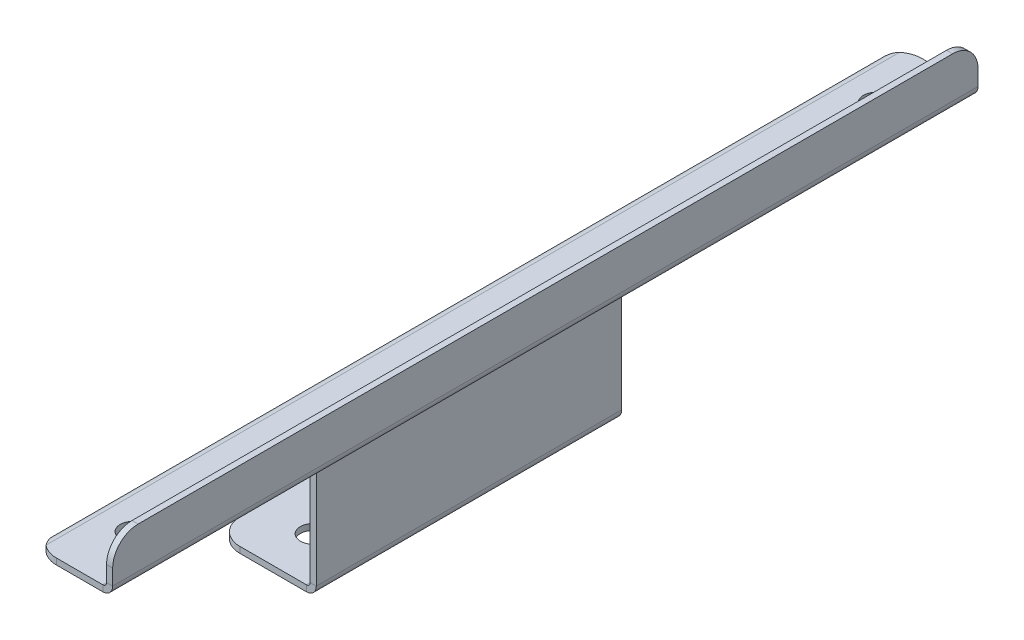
ISO-10303-21;
HEADER;
FILE_DESCRIPTION(('STEP AP214'),'2;1');
FILE_NAME('part.step','',(''),(''),'','','');
FILE_SCHEMA(('AUTOMOTIVE_DESIGN { 1 0 10303 214 1 1 1 1 }'));
ENDSEC;
DATA;
#1=APPLICATION_CONTEXT('core data for automotive mechanical design processes');
#2=APPLICATION_PROTOCOL_DEFINITION('international standard','automotive_design',2000,#1);
#3=PRODUCT_CONTEXT('',#1,'mechanical');
#4=PRODUCT('Part','Part','',(#3));
#5=PRODUCT_RELATED_PRODUCT_CATEGORY('part','',(#4));
#6=PRODUCT_DEFINITION_FORMATION('','',#4);
#7=PRODUCT_DEFINITION_CONTEXT('part definition',#1,'design');
#8=PRODUCT_DEFINITION('design','',#6,#7);
#9=PRODUCT_DEFINITION_SHAPE('','',#8);
#10=(LENGTH_UNIT() NAMED_UNIT(*) SI_UNIT(.MILLI.,.METRE.));
#11=(NAMED_UNIT(*) PLANE_ANGLE_UNIT() SI_UNIT($,.RADIAN.));
#12=(NAMED_UNIT(*) SI_UNIT($,.STERADIAN.) SOLID_ANGLE_UNIT());
#13=UNCERTAINTY_MEASURE_WITH_UNIT(LENGTH_MEASURE(1.E-05),#10,'distance_accuracy_value','');
#14=(GEOMETRIC_REPRESENTATION_CONTEXT(3) GLOBAL_UNCERTAINTY_ASSIGNED_CONTEXT((#13)) GLOBAL_UNIT_ASSIGNED_CONTEXT((#10,
#11,#12)) REPRESENTATION_CONTEXT('',''));
#15=CARTESIAN_POINT('',(0.,0.,0.));
#16=DIRECTION('',(0.,0.,1.));
#17=DIRECTION('',(1.,0.,0.));
#18=AXIS2_PLACEMENT_3D('',#15,#16,#17);
#19=CARTESIAN_POINT('',(-14.2634,-10.7366,170.));
#20=DIRECTION('',(0.,0.,-1.));
#21=DIRECTION('',(-1.,0.,0.));
#22=AXIS2_PLACEMENT_3D('',#19,#20,#21);
#23=CYLINDRICAL_SURFACE('',#22,0.7366);
#24=CARTESIAN_POINT('',(-14.2634,-10.,168.834397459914));
#25=CARTESIAN_POINT('',(-14.2931652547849,-9.99999086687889,168.714978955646));
#26=CARTESIAN_POINT('',(-14.3229307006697,-10.0018038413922,168.595561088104));
#27=CARTESIAN_POINT('',(-14.3820315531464,-10.0090089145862,168.356723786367));
#28=CARTESIAN_POINT('',(-14.4113669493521,-10.0144010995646,168.237304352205));
#29=CARTESIAN_POINT('',(-14.4691629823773,-10.0286963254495,167.998519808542));
#30=CARTESIAN_POINT('',(-14.4976240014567,-10.0375978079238,167.879154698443));
#31=CARTESIAN_POINT('',(-14.553250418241,-10.0587709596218,167.640427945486));
#32=CARTESIAN_POINT('',(-14.5804158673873,-10.0710424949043,167.521066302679));
#33=CARTESIAN_POINT('',(-14.6418638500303,-10.1034179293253,167.242425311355));
#34=CARTESIAN_POINT('',(-14.6754889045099,-10.124768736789,167.083143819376));
#35=CARTESIAN_POINT('',(-14.7388671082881,-10.1726070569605,166.764594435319));
#36=CARTESIAN_POINT('',(-14.7686204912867,-10.199094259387,166.605326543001));
#37=CARTESIAN_POINT('',(-14.8236366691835,-10.2566976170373,166.285839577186));
#38=CARTESIAN_POINT('',(-14.8488715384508,-10.2878405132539,166.125620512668));
#39=CARTESIAN_POINT('',(-14.893987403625,-10.3537833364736,165.805154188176));
#40=CARTESIAN_POINT('',(-14.9138675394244,-10.3885838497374,165.644906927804));
#41=CARTESIAN_POINT('',(-14.9307444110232,-10.4247811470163,165.484656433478));
#42=B_SPLINE_CURVE_WITH_KNOTS('',3,(#24,#25,#26,#27,#28,#29,#30,#31,#32,#33,#34,#35,#36,#37,#38,
#39,#40,#41),.UNSPECIFIED.,.F.,.F.,(4,2,2,2,2,2,2,2,4),(0.,0.369202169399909,0.738413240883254,
1.10746053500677,1.47649316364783,1.9689202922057,2.46131768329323,2.9566604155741,
3.45208266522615),.UNSPECIFIED.);
#43=CARTESIAN_POINT('',(-14.2634,-10.,168.834397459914));
#44=VERTEX_POINT('',#43);
#45=CARTESIAN_POINT('',(-14.9307444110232,-10.4247811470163,165.484656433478));
#46=VERTEX_POINT('',#45);
#47=EDGE_CURVE('E410',#44,#46,#42,.T.);
#48=ORIENTED_EDGE('',*,*,#47,.T.);
#49=CARTESIAN_POINT('',(-14.9307444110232,-10.4247811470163,165.484656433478));
#50=CARTESIAN_POINT('',(-14.9313540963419,-10.4260859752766,165.464462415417));
#51=CARTESIAN_POINT('',(-14.9319599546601,-10.4273925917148,165.444268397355));
#52=CARTESIAN_POINT('',(-14.9331639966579,-10.4300093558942,165.403880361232));
#53=CARTESIAN_POINT('',(-14.9337621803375,-10.4313195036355,165.38368634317));
#54=CARTESIAN_POINT('',(-14.9349508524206,-10.4339432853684,165.343298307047));
#55=CARTESIAN_POINT('',(-14.9355413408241,-10.4352569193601,165.323104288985));
#56=CARTESIAN_POINT('',(-14.936714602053,-10.4378876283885,165.282716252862));
#57=CARTESIAN_POINT('',(-14.9372973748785,-10.4392047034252,165.262522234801));
#58=CARTESIAN_POINT('',(-14.938455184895,-10.4418422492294,165.222134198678));
#59=CARTESIAN_POINT('',(-14.9390302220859,-10.4431627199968,165.201940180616));
#60=CARTESIAN_POINT('',(-14.9401725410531,-10.4458070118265,165.161552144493));
#61=CARTESIAN_POINT('',(-14.9407398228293,-10.4471308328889,165.141358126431));
#62=CARTESIAN_POINT('',(-14.9418666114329,-10.4497817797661,165.100970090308));
#63=CARTESIAN_POINT('',(-14.9424261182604,-10.451108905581,165.080776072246));
#64=CARTESIAN_POINT('',(-14.9435373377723,-10.453766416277,165.040388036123));
#65=CARTESIAN_POINT('',(-14.9440890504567,-10.4550968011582,165.020194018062));
#66=CARTESIAN_POINT('',(-14.9446368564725,-10.4564287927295,165.));
#67=B_SPLINE_CURVE_WITH_KNOTS('',3,(#49,#50,#51,#52,#53,#54,#55,#56,#57,#58,#59,#60,#61,#62,#63,
#64,#65,#66),.UNSPECIFIED.,.F.,.F.,(4,2,2,2,2,2,2,2,4),(0.,0.0607359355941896,0.121471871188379,
0.182207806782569,0.242943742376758,0.303679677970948,0.364415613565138,0.425151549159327,
0.485887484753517),.UNSPECIFIED.);
#68=CARTESIAN_POINT('',(-14.9446368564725,-10.4564287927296,165.));
#69=VERTEX_POINT('',#68);
#70=EDGE_CURVE('E402',#46,#69,#67,.T.);
#71=ORIENTED_EDGE('',*,*,#70,.T.);
#72=DIRECTION('',(0.,0.,-1.));
#73=VECTOR('',#72,1.);
#74=CARTESIAN_POINT('',(-14.9446368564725,-10.4564287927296,170.));
#75=LINE('',#74,#73);
#76=CARTESIAN_POINT('',(-14.9446368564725,-10.4564287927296,115.));
#77=VERTEX_POINT('',#76);
#78=EDGE_CURVE('E465',#77,#69,#75,.F.);
#79=ORIENTED_EDGE('',*,*,#78,.F.);
#80=CARTESIAN_POINT('',(-14.2634,-10.7366,115.));
#81=DIRECTION('',(0.,0.,-1.));
#82=DIRECTION('',(-1.,0.,0.));
#83=AXIS2_PLACEMENT_3D('',#80,#81,#82);
#84=CIRCLE('',#83,0.7366);
#85=CARTESIAN_POINT('',(-15.,-10.7366,115.));
#86=VERTEX_POINT('',#85);
#87=EDGE_CURVE('E474',#86,#77,#84,.T.);
#88=ORIENTED_EDGE('',*,*,#87,.F.);
#89=DIRECTION('',(0.,0.,-1.));
#90=VECTOR('',#89,1.);
#91=CARTESIAN_POINT('',(-15.,-10.7366,170.));
#92=LINE('',#91,#90);
#93=CARTESIAN_POINT('',(-15.,-10.7366,54.9999999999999));
#94=VERTEX_POINT('',#93);
#95=EDGE_CURVE('E316',#86,#94,#92,.T.);
#96=ORIENTED_EDGE('',*,*,#95,.T.);
#97=CARTESIAN_POINT('',(-14.2634,-10.7366,54.9999999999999));
#98=DIRECTION('',(0.,0.,-1.));
#99=DIRECTION('',(-1.,0.,0.));
#100=AXIS2_PLACEMENT_3D('',#97,#98,#99);
#101=CIRCLE('',#100,0.7366);
#102=CARTESIAN_POINT('',(-14.9446368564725,-10.4564287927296,54.9999999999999));
#103=VERTEX_POINT('',#102);
#104=EDGE_CURVE('E761',#103,#94,#101,.F.);
#105=ORIENTED_EDGE('',*,*,#104,.F.);
#106=DIRECTION('',(0.,0.,-1.));
#107=VECTOR('',#106,1.);
#108=CARTESIAN_POINT('',(-14.9446368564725,-10.4564287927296,170.));
#109=LINE('',#108,#107);
#110=CARTESIAN_POINT('',(-14.9446368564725,-10.4564287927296,5.));
#111=VERTEX_POINT('',#110);
#112=EDGE_CURVE('E542',#111,#103,#109,.F.);
#113=ORIENTED_EDGE('',*,*,#112,.F.);
#114=CARTESIAN_POINT('',(-14.9446368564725,-10.4564287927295,5.00000000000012));
#115=CARTESIAN_POINT('',(-14.9426636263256,-10.4516465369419,4.91813903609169));
#116=CARTESIAN_POINT('',(-14.9403137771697,-10.4460609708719,4.83633454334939));
#117=CARTESIAN_POINT('',(-14.934733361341,-10.4333815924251,4.67287004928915));
#118=CARTESIAN_POINT('',(-14.9315027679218,-10.4262877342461,4.59121005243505));
#119=CARTESIAN_POINT('',(-14.9240334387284,-10.410690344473,4.42806998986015));
#120=CARTESIAN_POINT('',(-14.9197946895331,-10.4021867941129,4.34658992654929));
#121=CARTESIAN_POINT('',(-14.9101434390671,-10.3838820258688,4.18376126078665));
#122=CARTESIAN_POINT('',(-14.9047297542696,-10.3740795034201,4.10241287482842));
#123=CARTESIAN_POINT('',(-14.892535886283,-10.3533086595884,3.93996979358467));
#124=CARTESIAN_POINT('',(-14.8857557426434,-10.3423403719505,3.85887509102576));
#125=CARTESIAN_POINT('',(-14.8706638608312,-10.3194695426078,3.69696266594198));
#126=CARTESIAN_POINT('',(-14.8623521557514,-10.3075670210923,3.61614493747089));
#127=CARTESIAN_POINT('',(-14.8418134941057,-10.2801149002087,3.43532841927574));
#128=CARTESIAN_POINT('',(-14.8291257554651,-10.2643785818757,3.3354096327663));
#129=CARTESIAN_POINT('',(-14.8007312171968,-10.2323053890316,3.13609808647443));
#130=CARTESIAN_POINT('',(-14.7850244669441,-10.2159685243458,3.03670531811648));
#131=CARTESIAN_POINT('',(-14.7503030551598,-10.1833644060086,2.83863886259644));
#132=CARTESIAN_POINT('',(-14.7312932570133,-10.1670970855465,2.73996433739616));
#133=CARTESIAN_POINT('',(-14.689863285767,-10.1354430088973,2.54318537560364));
#134=CARTESIAN_POINT('',(-14.6674430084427,-10.120056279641,2.44508095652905));
#135=CARTESIAN_POINT('',(-14.6185737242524,-10.0906428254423,2.24763156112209));
#136=CARTESIAN_POINT('',(-14.5920558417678,-10.0766477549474,2.14829876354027));
#137=CARTESIAN_POINT('',(-14.535258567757,-10.0513010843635,1.95038434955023));
#138=CARTESIAN_POINT('',(-14.5049797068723,-10.0399491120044,1.8518026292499));
#139=CARTESIAN_POINT('',(-14.4410633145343,-10.0209642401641,1.65488419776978));
#140=CARTESIAN_POINT('',(-14.4074117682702,-10.0133477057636,1.55655040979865));
#141=CARTESIAN_POINT('',(-14.3373466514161,-10.0028648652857,1.36054761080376));
#142=CARTESIAN_POINT('',(-14.3009312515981,-10.0000017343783,1.26287908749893));
#143=CARTESIAN_POINT('',(-14.2634,-10.,1.1656025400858));
#144=B_SPLINE_CURVE_WITH_KNOTS('',3,(#114,#115,#116,#117,#118,#119,#120,#121,#122,#123,#124,
#125,#126,#127,#128,#129,#130,#131,#132,#133,#134,#135,#136,#137,#138,#139,#140,#141,#142,#143),
.UNSPECIFIED.,.F.,.F.,(4,2,2,2,2,2,2,2,2,2,2,2,2,2,4),(0.,0.246067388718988,0.492142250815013,
0.738220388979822,0.984547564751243,1.23086761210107,1.47718233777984,1.78296665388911,
2.08874596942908,2.39407881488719,2.69942099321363,3.0106054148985,3.32174598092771,
3.6342377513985,3.94693817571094),.UNSPECIFIED.);
#145=CARTESIAN_POINT('',(-14.2634,-10.,1.1656025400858));
#146=VERTEX_POINT('',#145);
#147=EDGE_CURVE('E77',#111,#146,#144,.T.);
#148=ORIENTED_EDGE('',*,*,#147,.T.);
#149=DIRECTION('',(0.,0.,-1.));
#150=VECTOR('',#149,1.);
#151=CARTESIAN_POINT('',(-14.2634,-10.,170.));
#152=LINE('',#151,#150);
#153=EDGE_CURVE('E313',#44,#146,#152,.T.);
#154=ORIENTED_EDGE('',*,*,#153,.F.);
#155=EDGE_LOOP('',(#48,#71,#79,#88,#96,#105,#113,#148,#154));
#156=FACE_BOUND('',#155,.T.);
#157=ADVANCED_FACE('F52',(#156),#23,.F.);
#158=CARTESIAN_POINT('',(-14.2634,-10.7366,170.));
#159=DIRECTION('',(0.,0.,-1.));
#160=DIRECTION('',(-1.,0.,0.));
#161=AXIS2_PLACEMENT_3D('',#158,#159,#160);
#162=CYLINDRICAL_SURFACE('',#161,1.9366);
#163=CARTESIAN_POINT('',(-16.0179196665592,-9.91679496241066,165.484656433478));
#164=CARTESIAN_POINT('',(-16.0195225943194,-9.92022549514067,165.464462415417));
#165=CARTESIAN_POINT('',(-16.021115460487,-9.92366072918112,165.444268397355));
#166=CARTESIAN_POINT('',(-16.0242810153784,-9.9305404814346,165.403880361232));
#167=CARTESIAN_POINT('',(-16.0258537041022,-9.93398499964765,165.38368634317));
#168=CARTESIAN_POINT('',(-16.0289788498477,-9.94088320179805,165.343298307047));
#169=CARTESIAN_POINT('',(-16.0305313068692,-9.94433688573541,165.323104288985));
#170=CARTESIAN_POINT('',(-16.0336159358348,-9.95125330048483,165.282716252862));
#171=CARTESIAN_POINT('',(-16.0351481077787,-9.9547160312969,165.262522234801));
#172=CARTESIAN_POINT('',(-16.0381921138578,-9.96165042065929,165.222134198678));
#173=CARTESIAN_POINT('',(-16.039703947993,-9.96512207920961,165.201940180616));
#174=CARTESIAN_POINT('',(-16.0427072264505,-9.97207420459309,165.161552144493));
#175=CARTESIAN_POINT('',(-16.0441986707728,-9.97555467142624,165.141358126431));
#176=CARTESIAN_POINT('',(-16.0471611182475,-9.98252429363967,165.100970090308));
#177=CARTESIAN_POINT('',(-16.0486321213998,-9.98601344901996,165.080776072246));
#178=CARTESIAN_POINT('',(-16.0515536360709,-9.99300032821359,165.040388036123));
#179=CARTESIAN_POINT('',(-16.0530041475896,-9.99649805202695,165.020194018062));
#180=CARTESIAN_POINT('',(-16.0544443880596,-9.99999999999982,165.));
#181=B_SPLINE_CURVE_WITH_KNOTS('',3,(#163,#164,#165,#166,#167,#168,#169,#170,#171,#172,#173,
#174,#175,#176,#177,#178,#179,#180),.UNSPECIFIED.,.F.,.F.,(4,2,2,2,2,2,2,2,4),(0.,
0.0616378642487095,0.123275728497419,0.184913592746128,0.246551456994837,0.308189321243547,
0.369827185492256,0.431465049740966,0.493102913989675),.UNSPECIFIED.);
#182=CARTESIAN_POINT('',(-16.0179196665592,-9.91679496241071,165.484656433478));
#183=VERTEX_POINT('',#182);
#184=CARTESIAN_POINT('',(-16.0544443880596,-10.,165.));
#185=VERTEX_POINT('',#184);
#186=EDGE_CURVE('E69',#183,#185,#181,.T.);
#187=ORIENTED_EDGE('',*,*,#186,.F.);
#188=CARTESIAN_POINT('',(-14.2633999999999,-8.80000000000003,168.834397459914));
#189=CARTESIAN_POINT('',(-14.312485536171,-8.79999879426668,168.759502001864));
#190=CARTESIAN_POINT('',(-14.3615613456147,-8.80186688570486,168.684612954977));
#191=CARTESIAN_POINT('',(-14.4594296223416,-8.80932199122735,168.534836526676));
#192=CARTESIAN_POINT('',(-14.5082220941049,-8.81490894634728,168.459949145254));
#193=CARTESIAN_POINT('',(-14.6536863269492,-8.83720417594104,168.235415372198));
#194=CARTESIAN_POINT('',(-14.749541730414,-8.8594468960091,168.08575122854));
#195=CARTESIAN_POINT('',(-14.9367239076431,-8.91817227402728,167.786485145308));
#196=CARTESIAN_POINT('',(-15.0280521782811,-8.95465018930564,167.636883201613));
#197=CARTESIAN_POINT('',(-15.2041618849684,-9.04101604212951,167.337603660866));
#198=CARTESIAN_POINT('',(-15.2889409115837,-9.09090888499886,167.187926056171));
#199=CARTESIAN_POINT('',(-15.4389827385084,-9.1953003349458,166.909000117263));
#200=CARTESIAN_POINT('',(-15.5053303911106,-9.24824321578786,166.779749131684));
#201=CARTESIAN_POINT('',(-15.6305684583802,-9.36239125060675,166.521221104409));
#202=CARTESIAN_POINT('',(-15.6894566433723,-9.42359886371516,166.391944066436));
#203=CARTESIAN_POINT('',(-15.7988647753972,-9.55339017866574,166.132992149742));
#204=CARTESIAN_POINT('',(-15.8493587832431,-9.62199570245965,166.003317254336));
#205=CARTESIAN_POINT('',(-15.9409164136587,-9.7652014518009,165.743982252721));
#206=CARTESIAN_POINT('',(-15.9819817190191,-9.83980060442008,165.614322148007));
#207=CARTESIAN_POINT('',(-16.0179196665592,-9.91679496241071,165.484656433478));
#208=B_SPLINE_CURVE_WITH_KNOTS('',3,(#188,#189,#190,#191,#192,#193,#194,#195,#196,#197,#198,
#199,#200,#201,#202,#203,#204,#205,#206,#207),.UNSPECIFIED.,.F.,.F.,(4,2,2,2,2,2,2,2,2,4),(0.,
0.268601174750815,0.537198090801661,1.07386770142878,1.61035866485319,2.14704606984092,
2.61055153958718,3.07419522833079,3.53924603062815,4.00421376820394),.UNSPECIFIED.);
#209=CARTESIAN_POINT('',(-14.2633999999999,-8.80000000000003,168.834397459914));
#210=VERTEX_POINT('',#209);
#211=EDGE_CURVE('E429',#210,#183,#208,.T.);
#212=ORIENTED_EDGE('',*,*,#211,.F.);
#213=DIRECTION('',(0.,0.,-1.));
#214=VECTOR('',#213,1.);
#215=CARTESIAN_POINT('',(-14.2634,-8.80000000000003,170.));
#216=LINE('',#215,#214);
#217=CARTESIAN_POINT('',(-14.2634,-8.80000000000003,1.1656025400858));
#218=VERTEX_POINT('',#217);
#219=EDGE_CURVE('E257',#210,#218,#216,.T.);
#220=ORIENTED_EDGE('',*,*,#219,.T.);
#221=CARTESIAN_POINT('',(-16.0544443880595,-9.99999999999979,5.00000000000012));
#222=CARTESIAN_POINT('',(-16.0486900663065,-9.98604772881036,4.90911741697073));
#223=CARTESIAN_POINT('',(-16.0417287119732,-9.96954488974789,4.81872036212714));
#224=CARTESIAN_POINT('',(-16.0250772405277,-9.93202027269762,4.63923051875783));
#225=CARTESIAN_POINT('',(-16.0153902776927,-9.91100372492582,4.55013634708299));
#226=CARTESIAN_POINT('',(-15.9929646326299,-9.86500634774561,4.37340263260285));
#227=CARTESIAN_POINT('',(-15.9802269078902,-9.84002676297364,4.28576264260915));
#228=CARTESIAN_POINT('',(-15.9513181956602,-9.78672014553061,4.11212480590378));
#229=CARTESIAN_POINT('',(-15.9351486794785,-9.75839454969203,4.02612627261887));
#230=CARTESIAN_POINT('',(-15.8989869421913,-9.69906505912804,3.85586152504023));
#231=CARTESIAN_POINT('',(-15.8789941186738,-9.66806074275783,3.77159558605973));
#232=CARTESIAN_POINT('',(-15.8349385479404,-9.60426134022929,3.60482268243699));
#233=CARTESIAN_POINT('',(-15.8108755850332,-9.571466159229,3.52231581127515));
#234=CARTESIAN_POINT('',(-15.7575168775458,-9.50373560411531,3.35631387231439));
#235=CARTESIAN_POINT('',(-15.7280706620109,-9.46876538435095,3.27288106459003));
#236=CARTESIAN_POINT('',(-15.6802372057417,-9.41616283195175,3.14922345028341));
#237=CARTESIAN_POINT('',(-15.6636814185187,-9.39860352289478,3.1082515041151));
#238=CARTESIAN_POINT('',(-15.6293105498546,-9.36353391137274,3.02681810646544));
#239=CARTESIAN_POINT('',(-15.6114954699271,-9.34602360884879,2.98635665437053));
#240=CARTESIAN_POINT('',(-15.5561721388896,-9.29377958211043,2.86569217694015));
#241=CARTESIAN_POINT('',(-15.516787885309,-9.25933507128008,2.78621442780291));
#242=CARTESIAN_POINT('',(-15.4333464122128,-9.19242004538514,2.62950413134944));
#243=CARTESIAN_POINT('',(-15.3893144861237,-9.15994021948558,2.55226207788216));
#244=CARTESIAN_POINT('',(-15.2965476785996,-9.09765271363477,2.39954837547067));
#245=CARTESIAN_POINT('',(-15.2478132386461,-9.06784478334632,2.32407656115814));
#246=CARTESIAN_POINT('',(-15.1457826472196,-9.01172127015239,2.17496806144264));
#247=CARTESIAN_POINT('',(-15.0924881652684,-8.98540441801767,2.10133071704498));
#248=CARTESIAN_POINT('',(-14.9990584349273,-8.94468870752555,1.97869556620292));
#249=CARTESIAN_POINT('',(-14.9600442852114,-8.92914198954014,1.92921967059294));
#250=CARTESIAN_POINT('',(-14.8802546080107,-8.90037870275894,1.83102676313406));
#251=CARTESIAN_POINT('',(-14.8394793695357,-8.88716175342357,1.78230962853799));
#252=CARTESIAN_POINT('',(-14.7563689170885,-8.86329544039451,1.68559868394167));
#253=CARTESIAN_POINT('',(-14.7140340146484,-8.85264556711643,1.63760473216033));
#254=CARTESIAN_POINT('',(-14.6275171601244,-8.83401788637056,1.54176657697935));
#255=CARTESIAN_POINT('',(-14.5833197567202,-8.82607158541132,1.49393017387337));
#256=CARTESIAN_POINT('',(-14.4937322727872,-8.81321384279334,1.39894436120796));
#257=CARTESIAN_POINT('',(-14.4483418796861,-8.80830320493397,1.35179513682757));
#258=CARTESIAN_POINT('',(-14.3565590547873,-8.80169370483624,1.25817476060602));
#259=CARTESIAN_POINT('',(-14.3101657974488,-8.79999759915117,1.21170422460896));
#260=CARTESIAN_POINT('',(-14.2633999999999,-8.80000000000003,1.1656025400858));
#261=B_SPLINE_CURVE_WITH_KNOTS('',3,(#221,#222,#223,#224,#225,#226,#227,#228,#229,#230,#231,
#232,#233,#234,#235,#236,#237,#238,#239,#240,#241,#242,#243,#244,#245,#246,#247,#248,#249,#250,
#251,#252,#253,#254,#255,#256,#257,#258,#259,#260),.UNSPECIFIED.,.F.,.F.,(4,2,2,2,2,2,2,2,2,2,2,
2,2,2,2,2,2,2,2,4),(0.,0.276312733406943,0.552307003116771,0.828214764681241,1.10400447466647,
1.3798376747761,1.65568549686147,1.94094078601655,2.08357794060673,2.22621492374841,
2.51150758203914,2.79532070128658,3.07910720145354,3.36279024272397,3.55741811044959,
3.75201415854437,3.94657154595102,4.14332424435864,4.34012901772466,4.53710248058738),.UNSPECIFIED.);
#262=CARTESIAN_POINT('',(-16.0544443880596,-10.,5.00000000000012));
#263=VERTEX_POINT('',#262);
#264=EDGE_CURVE('E544',#263,#218,#261,.T.);
#265=ORIENTED_EDGE('',*,*,#264,.F.);
#266=DIRECTION('',(0.,0.,-1.));
#267=VECTOR('',#266,1.);
#268=CARTESIAN_POINT('',(-16.0544443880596,-10.,170.));
#269=LINE('',#268,#267);
#270=CARTESIAN_POINT('',(-16.0544443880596,-10.,54.9999999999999));
#271=VERTEX_POINT('',#270);
#272=EDGE_CURVE('E753',#263,#271,#269,.F.);
#273=ORIENTED_EDGE('',*,*,#272,.T.);
#274=CARTESIAN_POINT('',(-14.2634,-10.7366,54.9999999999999));
#275=DIRECTION('',(0.,0.,1.));
#276=DIRECTION('',(1.,0.,0.));
#277=AXIS2_PLACEMENT_3D('',#274,#275,#276);
#278=CIRCLE('',#277,1.9366);
#279=CARTESIAN_POINT('',(-16.2,-10.7366,54.9999999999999));
#280=VERTEX_POINT('',#279);
#281=EDGE_CURVE('E762',#271,#280,#278,.T.);
#282=ORIENTED_EDGE('',*,*,#281,.T.);
#283=DIRECTION('',(0.,0.,-1.));
#284=VECTOR('',#283,1.);
#285=CARTESIAN_POINT('',(-16.2,-10.7366,170.));
#286=LINE('',#285,#284);
#287=CARTESIAN_POINT('',(-16.2,-10.7366,115.));
#288=VERTEX_POINT('',#287);
#289=EDGE_CURVE('E292',#288,#280,#286,.T.);
#290=ORIENTED_EDGE('',*,*,#289,.F.);
#291=CARTESIAN_POINT('',(-14.2634,-10.7366,115.));
#292=DIRECTION('',(0.,0.,-1.));
#293=DIRECTION('',(-1.,0.,0.));
#294=AXIS2_PLACEMENT_3D('',#291,#292,#293);
#295=CIRCLE('',#294,1.9366);
#296=CARTESIAN_POINT('',(-16.0544443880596,-10.,115.));
#297=VERTEX_POINT('',#296);
#298=EDGE_CURVE('E475',#288,#297,#295,.T.);
#299=ORIENTED_EDGE('',*,*,#298,.T.);
#300=DIRECTION('',(0.,0.,-1.));
#301=VECTOR('',#300,1.);
#302=CARTESIAN_POINT('',(-16.0544443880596,-10.,170.));
#303=LINE('',#302,#301);
#304=EDGE_CURVE('E479',#297,#185,#303,.F.);
#305=ORIENTED_EDGE('',*,*,#304,.T.);
#306=EDGE_LOOP('',(#187,#212,#220,#265,#273,#282,#290,#299,#305));
#307=FACE_BOUND('',#306,.T.);
#308=ADVANCED_FACE('F581',(#307),#162,.T.);
#309=CARTESIAN_POINT('',(-1.19999999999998,-8.06340000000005,170.));
#310=DIRECTION('',(0.,0.,1.));
#311=DIRECTION('',(1.,0.,0.));
#312=AXIS2_PLACEMENT_3D('',#309,#310,#311);
#313=PLANE('',#312);
#314=DIRECTION('',(-1.,0.,0.));
#315=VECTOR('',#314,1.);
#316=CARTESIAN_POINT('',(0.,-8.80000000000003,170.));
#317=LINE('',#316,#315);
#318=CARTESIAN_POINT('',(-1.93660000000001,-8.80000000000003,170.));
#319=VERTEX_POINT('',#318);
#320=CARTESIAN_POINT('',(-11.0544443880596,-8.80000000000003,170.));
#321=VERTEX_POINT('',#320);
#322=EDGE_CURVE('E254',#319,#321,#317,.T.);
#323=ORIENTED_EDGE('',*,*,#322,.T.);
#324=DIRECTION('',(0.,-1.,0.));
#325=VECTOR('',#324,1.);
#326=CARTESIAN_POINT('',(-11.0544443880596,-8.80000000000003,170.));
#327=LINE('',#326,#325);
#328=CARTESIAN_POINT('',(-11.0544443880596,-10.,170.));
#329=VERTEX_POINT('',#328);
#330=EDGE_CURVE('E235',#329,#321,#327,.F.);
#331=ORIENTED_EDGE('',*,*,#330,.F.);
#332=DIRECTION('',(-1.,0.,0.));
#333=VECTOR('',#332,1.);
#334=CARTESIAN_POINT('',(0.,-10.,170.));
#335=LINE('',#334,#333);
#336=CARTESIAN_POINT('',(-1.93660000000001,-10.,170.));
#337=VERTEX_POINT('',#336);
#338=EDGE_CURVE('E288',#337,#329,#335,.T.);
#339=ORIENTED_EDGE('',*,*,#338,.F.);
#340=DIRECTION('',(0.,1.,0.));
#341=VECTOR('',#340,1.);
#342=CARTESIAN_POINT('',(-1.93660000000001,-10.,170.));
#343=LINE('',#342,#341);
#344=EDGE_CURVE('E260',#337,#319,#343,.T.);
#345=ORIENTED_EDGE('',*,*,#344,.T.);
#346=EDGE_LOOP('',(#323,#331,#339,#345));
#347=FACE_BOUND('',#346,.T.);
#348=ADVANCED_FACE('F259',(#347),#313,.T.);
#349=CARTESIAN_POINT('',(0.,-10.,170.));
#350=DIRECTION('',(0.,-1.,0.));
#351=DIRECTION('',(1.,0.,0.));
#352=AXIS2_PLACEMENT_3D('',#349,#350,#351);
#353=PLANE('',#352);
#354=CARTESIAN_POINT('',(-7.99999999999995,-10.,12.));
#355=DIRECTION('',(0.,-1.,0.));
#356=DIRECTION('',(1.,0.,0.));
#357=AXIS2_PLACEMENT_3D('',#354,#355,#356);
#358=CIRCLE('',#357,2.5);
#359=CARTESIAN_POINT('',(-5.49999999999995,-10.,12.));
#360=VERTEX_POINT('',#359);
#361=EDGE_CURVE('E393',#360,#360,#358,.T.);
#362=ORIENTED_EDGE('',*,*,#361,.F.);
#363=EDGE_LOOP('',(#362));
#364=FACE_BOUND('',#363,.T.);
#365=CARTESIAN_POINT('',(-7.99999999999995,-10.,158.));
#366=DIRECTION('',(0.,-1.,0.));
#367=DIRECTION('',(1.,0.,0.));
#368=AXIS2_PLACEMENT_3D('',#365,#366,#367);
#369=CIRCLE('',#368,2.5);
#370=CARTESIAN_POINT('',(-5.49999999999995,-10.,158.));
#371=VERTEX_POINT('',#370);
#372=EDGE_CURVE('E390',#371,#371,#369,.T.);
#373=ORIENTED_EDGE('',*,*,#372,.F.);
#374=EDGE_LOOP('',(#373));
#375=FACE_BOUND('',#374,.T.);
#376=ORIENTED_EDGE('',*,*,#338,.T.);
#377=CARTESIAN_POINT('',(-11.0544443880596,-10.,165.));
#378=DIRECTION('',(0.,1.,0.));
#379=DIRECTION('',(-1.,0.,0.));
#380=AXIS2_PLACEMENT_3D('',#377,#378,#379);
#381=CIRCLE('',#380,5.);
#382=EDGE_CURVE('E242',#44,#329,#381,.T.);
#383=ORIENTED_EDGE('',*,*,#382,.F.);
#384=ORIENTED_EDGE('',*,*,#153,.T.);
#385=CARTESIAN_POINT('',(-11.0544443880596,-10.,5.));
#386=DIRECTION('',(0.,1.,0.));
#387=DIRECTION('',(-1.,0.,0.));
#388=AXIS2_PLACEMENT_3D('',#385,#386,#387);
#389=CIRCLE('',#388,5.);
#390=CARTESIAN_POINT('',(-11.0544443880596,-10.,0.));
#391=VERTEX_POINT('',#390);
#392=EDGE_CURVE('E400',#391,#146,#389,.T.);
#393=ORIENTED_EDGE('',*,*,#392,.F.);
#394=DIRECTION('',(-1.,0.,0.));
#395=VECTOR('',#394,1.);
#396=CARTESIAN_POINT('',(0.,-10.,0.));
#397=LINE('',#396,#395);
#398=CARTESIAN_POINT('',(-1.93660000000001,-10.,0.));
#399=VERTEX_POINT('',#398);
#400=EDGE_CURVE('E272',#399,#391,#397,.T.);
#401=ORIENTED_EDGE('',*,*,#400,.F.);
#402=DIRECTION('',(0.,0.,-1.));
#403=VECTOR('',#402,1.);
#404=CARTESIAN_POINT('',(-1.93660000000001,-10.,170.));
#405=LINE('',#404,#403);
#406=EDGE_CURVE('E310',#337,#399,#405,.T.);
#407=ORIENTED_EDGE('',*,*,#406,.F.);
#408=EDGE_LOOP('',(#376,#383,#384,#393,#401,#407));
#409=FACE_BOUND('',#408,.T.);
#410=ADVANCED_FACE('F538',(#364,#375,#409),#353,.T.);
#411=CARTESIAN_POINT('',(0.,-8.80000000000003,170.));
#412=DIRECTION('',(0.,-1.,0.));
#413=DIRECTION('',(1.,0.,0.));
#414=AXIS2_PLACEMENT_3D('',#411,#412,#413);
#415=PLANE('',#414);
#416=CARTESIAN_POINT('',(-7.99999999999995,-8.80000000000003,12.));
#417=DIRECTION('',(0.,1.,0.));
#418=DIRECTION('',(-1.,0.,0.));
#419=AXIS2_PLACEMENT_3D('',#416,#417,#418);
#420=CIRCLE('',#419,2.5);
#421=CARTESIAN_POINT('',(-10.5,-8.80000000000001,12.));
#422=VERTEX_POINT('',#421);
#423=EDGE_CURVE('E374',#422,#422,#420,.T.);
#424=ORIENTED_EDGE('',*,*,#423,.F.);
#425=EDGE_LOOP('',(#424));
#426=FACE_BOUND('',#425,.T.);
#427=CARTESIAN_POINT('',(-7.99999999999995,-8.80000000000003,158.));
#428=DIRECTION('',(0.,1.,0.));
#429=DIRECTION('',(-1.,0.,0.));
#430=AXIS2_PLACEMENT_3D('',#427,#428,#429);
#431=CIRCLE('',#430,2.5);
#432=CARTESIAN_POINT('',(-10.5,-8.80000000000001,158.));
#433=VERTEX_POINT('',#432);
#434=EDGE_CURVE('E380',#433,#433,#431,.T.);
#435=ORIENTED_EDGE('',*,*,#434,.F.);
#436=EDGE_LOOP('',(#435));
#437=FACE_BOUND('',#436,.T.);
#438=CARTESIAN_POINT('',(-11.0544443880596,-8.80000000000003,165.));
#439=DIRECTION('',(0.,1.,0.));
#440=DIRECTION('',(-1.,0.,0.));
#441=AXIS2_PLACEMENT_3D('',#438,#439,#440);
#442=CIRCLE('',#441,5.);
#443=EDGE_CURVE('E239',#210,#321,#442,.T.);
#444=ORIENTED_EDGE('',*,*,#443,.T.);
#445=ORIENTED_EDGE('',*,*,#322,.F.);
#446=DIRECTION('',(0.,0.,-1.));
#447=VECTOR('',#446,1.);
#448=CARTESIAN_POINT('',(-1.93660000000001,-8.80000000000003,170.));
#449=LINE('',#448,#447);
#450=CARTESIAN_POINT('',(-1.93660000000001,-8.80000000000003,0.));
#451=VERTEX_POINT('',#450);
#452=EDGE_CURVE('E296',#319,#451,#449,.T.);
#453=ORIENTED_EDGE('',*,*,#452,.T.);
#454=DIRECTION('',(-1.,0.,0.));
#455=VECTOR('',#454,1.);
#456=CARTESIAN_POINT('',(0.,-8.80000000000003,0.));
#457=LINE('',#456,#455);
#458=CARTESIAN_POINT('',(-11.0544443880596,-8.80000000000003,0.));
#459=VERTEX_POINT('',#458);
#460=EDGE_CURVE('E286',#451,#459,#457,.T.);
#461=ORIENTED_EDGE('',*,*,#460,.T.);
#462=CARTESIAN_POINT('',(-11.0544443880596,-8.80000000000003,5.));
#463=DIRECTION('',(0.,1.,0.));
#464=DIRECTION('',(-1.,0.,0.));
#465=AXIS2_PLACEMENT_3D('',#462,#463,#464);
#466=CIRCLE('',#465,5.);
#467=EDGE_CURVE('E397',#459,#218,#466,.T.);
#468=ORIENTED_EDGE('',*,*,#467,.T.);
#469=ORIENTED_EDGE('',*,*,#219,.F.);
#470=EDGE_LOOP('',(#444,#445,#453,#461,#468,#469));
#471=FACE_BOUND('',#470,.T.);
#472=ADVANCED_FACE('F252',(#426,#437,#471),#415,.F.);
#473=CARTESIAN_POINT('',(-16.0544443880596,-10.,142.5));
#474=DIRECTION('',(0.380357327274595,0.924839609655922,0.));
#475=DIRECTION('',(0.,0.,-1.));
#476=AXIS2_PLACEMENT_3D('',#473,#474,#475);
#477=PLANE('',#476);
#478=ORIENTED_EDGE('',*,*,#78,.T.);
#479=DIRECTION('',(-0.924839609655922,0.380357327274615,0.));
#480=VECTOR('',#479,1.);
#481=CARTESIAN_POINT('',(-16.0544443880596,-10.,165.));
#482=LINE('',#481,#480);
#483=EDGE_CURVE('E409',#185,#69,#482,.F.);
#484=ORIENTED_EDGE('',*,*,#483,.F.);
#485=ORIENTED_EDGE('',*,*,#304,.F.);
#486=DIRECTION('',(-0.924839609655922,0.380357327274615,0.));
#487=VECTOR('',#486,1.);
#488=CARTESIAN_POINT('',(-16.0544443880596,-10.,115.));
#489=LINE('',#488,#487);
#490=EDGE_CURVE('E473',#297,#77,#489,.F.);
#491=ORIENTED_EDGE('',*,*,#490,.T.);
#492=EDGE_LOOP('',(#478,#484,#485,#491));
#493=FACE_BOUND('',#492,.T.);
#494=ADVANCED_FACE('F470',(#493),#477,.F.);
#495=CARTESIAN_POINT('',(-16.0544443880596,-10.,27.5));
#496=DIRECTION('',(0.380357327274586,0.924839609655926,0.));
#497=DIRECTION('',(0.,0.,-1.));
#498=AXIS2_PLACEMENT_3D('',#495,#496,#497);
#499=PLANE('',#498);
#500=ORIENTED_EDGE('',*,*,#272,.F.);
#501=DIRECTION('',(-0.924839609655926,0.380357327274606,0.));
#502=VECTOR('',#501,1.);
#503=CARTESIAN_POINT('',(-16.0544443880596,-10.,5.00000000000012));
#504=LINE('',#503,#502);
#505=EDGE_CURVE('E547',#263,#111,#504,.F.);
#506=ORIENTED_EDGE('',*,*,#505,.T.);
#507=ORIENTED_EDGE('',*,*,#112,.T.);
#508=DIRECTION('',(-0.924839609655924,0.380357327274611,0.));
#509=VECTOR('',#508,1.);
#510=CARTESIAN_POINT('',(-16.0544443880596,-10.,54.9999999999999));
#511=LINE('',#510,#509);
#512=EDGE_CURVE('E764',#271,#103,#511,.F.);
#513=ORIENTED_EDGE('',*,*,#512,.F.);
#514=EDGE_LOOP('',(#500,#506,#507,#513));
#515=FACE_BOUND('',#514,.T.);
#516=ADVANCED_FACE('F611',(#515),#499,.F.);
#517=CARTESIAN_POINT('',(-15.,-43.7999999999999,170.));
#518=DIRECTION('',(0.,-1.,0.));
#519=DIRECTION('',(1.,0.,0.));
#520=AXIS2_PLACEMENT_3D('',#517,#518,#519);
#521=PLANE('',#520);
#522=CARTESIAN_POINT('',(-24.9366,-43.7999999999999,105.68));
#523=DIRECTION('',(0.,-1.,0.));
#524=DIRECTION('',(1.,0.,0.));
#525=AXIS2_PLACEMENT_3D('',#522,#523,#524);
#526=CIRCLE('',#525,2.5);
#527=CARTESIAN_POINT('',(-22.4366,-43.8,105.68));
#528=VERTEX_POINT('',#527);
#529=EDGE_CURVE('E387',#528,#528,#526,.T.);
#530=ORIENTED_EDGE('',*,*,#529,.T.);
#531=EDGE_LOOP('',(#530));
#532=FACE_BOUND('',#531,.T.);
#533=CARTESIAN_POINT('',(-24.9366,-43.7999999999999,64.32));
#534=DIRECTION('',(0.,-1.,0.));
#535=DIRECTION('',(1.,0.,0.));
#536=AXIS2_PLACEMENT_3D('',#533,#534,#535);
#537=CIRCLE('',#536,2.5);
#538=CARTESIAN_POINT('',(-22.4366,-43.8,64.32));
#539=VERTEX_POINT('',#538);
#540=EDGE_CURVE('E373',#539,#539,#537,.T.);
#541=ORIENTED_EDGE('',*,*,#540,.T.);
#542=EDGE_LOOP('',(#541));
#543=FACE_BOUND('',#542,.T.);
#544=DIRECTION('',(-1.,0.,0.));
#545=VECTOR('',#544,1.);
#546=CARTESIAN_POINT('',(-25.9683,-43.7999999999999,54.9999999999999));
#547=LINE('',#546,#545);
#548=CARTESIAN_POINT('',(-30.,-43.8000000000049,54.9999999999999));
#549=VERTEX_POINT('',#548);
#550=CARTESIAN_POINT('',(-16.9366,-43.7999999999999,54.9999999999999));
#551=VERTEX_POINT('',#550);
#552=EDGE_CURVE('E543',#549,#551,#547,.F.);
#553=ORIENTED_EDGE('',*,*,#552,.F.);
#554=CARTESIAN_POINT('',(-30.,-43.8000000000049,60.));
#555=DIRECTION('',(0.,-1.,0.));
#556=DIRECTION('',(1.,0.,0.));
#557=AXIS2_PLACEMENT_3D('',#554,#555,#556);
#558=CIRCLE('',#557,5.);
#559=CARTESIAN_POINT('',(-35.,-43.8000000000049,60.));
#560=VERTEX_POINT('',#559);
#561=EDGE_CURVE('E354',#549,#560,#558,.F.);
#562=ORIENTED_EDGE('',*,*,#561,.T.);
#563=DIRECTION('',(0.,0.,-1.));
#564=VECTOR('',#563,1.);
#565=CARTESIAN_POINT('',(-35.,-43.8000000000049,170.));
#566=LINE('',#565,#564);
#567=CARTESIAN_POINT('',(-35.,-43.8000000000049,110.));
#568=VERTEX_POINT('',#567);
#569=EDGE_CURVE('E328',#568,#560,#566,.T.);
#570=ORIENTED_EDGE('',*,*,#569,.F.);
#571=CARTESIAN_POINT('',(-30.,-43.8000000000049,110.));
#572=DIRECTION('',(0.,-1.,0.));
#573=DIRECTION('',(1.,0.,0.));
#574=AXIS2_PLACEMENT_3D('',#571,#572,#573);
#575=CIRCLE('',#574,5.);
#576=CARTESIAN_POINT('',(-30.,-43.8000000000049,115.));
#577=VERTEX_POINT('',#576);
#578=EDGE_CURVE('E352',#568,#577,#575,.F.);
#579=ORIENTED_EDGE('',*,*,#578,.T.);
#580=DIRECTION('',(1.,0.,0.));
#581=VECTOR('',#580,1.);
#582=CARTESIAN_POINT('',(-125.,-43.8000000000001,115.));
#583=LINE('',#582,#581);
#584=CARTESIAN_POINT('',(-16.9366,-43.7999999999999,115.));
#585=VERTEX_POINT('',#584);
#586=EDGE_CURVE('E485',#577,#585,#583,.T.);
#587=ORIENTED_EDGE('',*,*,#586,.T.);
#588=DIRECTION('',(0.,0.,-1.));
#589=VECTOR('',#588,1.);
#590=CARTESIAN_POINT('',(-16.9366,-43.7999999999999,170.));
#591=LINE('',#590,#589);
#592=EDGE_CURVE('E262',#585,#551,#591,.T.);
#593=ORIENTED_EDGE('',*,*,#592,.T.);
#594=EDGE_LOOP('',(#553,#562,#570,#579,#587,#593));
#595=FACE_BOUND('',#594,.T.);
#596=ADVANCED_FACE('F607',(#532,#543,#595),#521,.F.);
#597=CARTESIAN_POINT('',(-35.,-45.000000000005,170.));
#598=DIRECTION('',(-1.,0.,0.));
#599=DIRECTION('',(0.,0.,1.));
#600=AXIS2_PLACEMENT_3D('',#597,#598,#599);
#601=PLANE('',#600);
#602=ORIENTED_EDGE('',*,*,#569,.T.);
#603=DIRECTION('',(0.,1.,0.));
#604=VECTOR('',#603,1.);
#605=CARTESIAN_POINT('',(-35.,-45.0000000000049,60.));
#606=LINE('',#605,#604);
#607=CARTESIAN_POINT('',(-35.,-45.000000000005,60.));
#608=VERTEX_POINT('',#607);
#609=EDGE_CURVE('E343',#560,#608,#606,.F.);
#610=ORIENTED_EDGE('',*,*,#609,.T.);
#611=DIRECTION('',(0.,0.,-1.));
#612=VECTOR('',#611,1.);
#613=CARTESIAN_POINT('',(-35.,-45.000000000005,170.));
#614=LINE('',#613,#612);
#615=CARTESIAN_POINT('',(-35.,-45.000000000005,110.));
#616=VERTEX_POINT('',#615);
#617=EDGE_CURVE('E325',#616,#608,#614,.T.);
#618=ORIENTED_EDGE('',*,*,#617,.F.);
#619=DIRECTION('',(0.,-1.,0.));
#620=VECTOR('',#619,1.);
#621=CARTESIAN_POINT('',(-35.,-45.0000000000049,110.));
#622=LINE('',#621,#620);
#623=EDGE_CURVE('E340',#616,#568,#622,.F.);
#624=ORIENTED_EDGE('',*,*,#623,.T.);
#625=EDGE_LOOP('',(#602,#610,#618,#624));
#626=FACE_BOUND('',#625,.T.);
#627=ADVANCED_FACE('F603',(#626),#601,.T.);
#628=CARTESIAN_POINT('',(-15.,-45.,170.));
#629=DIRECTION('',(0.,-1.,0.));
#630=DIRECTION('',(1.,0.,0.));
#631=AXIS2_PLACEMENT_3D('',#628,#629,#630);
#632=PLANE('',#631);
#633=CARTESIAN_POINT('',(-24.9366,-45.,105.68));
#634=DIRECTION('',(0.,-1.,0.));
#635=DIRECTION('',(1.,0.,0.));
#636=AXIS2_PLACEMENT_3D('',#633,#634,#635);
#637=CIRCLE('',#636,2.5);
#638=CARTESIAN_POINT('',(-22.4366,-45.0000000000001,105.68));
#639=VERTEX_POINT('',#638);
#640=EDGE_CURVE('E56',#639,#639,#637,.T.);
#641=ORIENTED_EDGE('',*,*,#640,.F.);
#642=EDGE_LOOP('',(#641));
#643=FACE_BOUND('',#642,.T.);
#644=CARTESIAN_POINT('',(-24.9366,-45.,64.32));
#645=DIRECTION('',(0.,-1.,0.));
#646=DIRECTION('',(1.,0.,0.));
#647=AXIS2_PLACEMENT_3D('',#644,#645,#646);
#648=CIRCLE('',#647,2.5);
#649=CARTESIAN_POINT('',(-22.4366,-45.0000000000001,64.32));
#650=VERTEX_POINT('',#649);
#651=EDGE_CURVE('E371',#650,#650,#648,.T.);
#652=ORIENTED_EDGE('',*,*,#651,.F.);
#653=EDGE_LOOP('',(#652));
#654=FACE_BOUND('',#653,.T.);
#655=ORIENTED_EDGE('',*,*,#617,.T.);
#656=CARTESIAN_POINT('',(-30.,-45.000000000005,60.));
#657=DIRECTION('',(0.,-1.,0.));
#658=DIRECTION('',(1.,0.,0.));
#659=AXIS2_PLACEMENT_3D('',#656,#657,#658);
#660=CIRCLE('',#659,5.);
#661=CARTESIAN_POINT('',(-30.,-45.000000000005,54.9999999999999));
#662=VERTEX_POINT('',#661);
#663=EDGE_CURVE('E348',#608,#662,#660,.T.);
#664=ORIENTED_EDGE('',*,*,#663,.T.);
#665=DIRECTION('',(1.,0.,0.));
#666=VECTOR('',#665,1.);
#667=CARTESIAN_POINT('',(-15.,-45.,54.9999999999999));
#668=LINE('',#667,#666);
#669=CARTESIAN_POINT('',(-16.9366,-45.,54.9999999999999));
#670=VERTEX_POINT('',#669);
#671=EDGE_CURVE('E545',#662,#670,#668,.T.);
#672=ORIENTED_EDGE('',*,*,#671,.T.);
#673=DIRECTION('',(0.,0.,-1.));
#674=VECTOR('',#673,1.);
#675=CARTESIAN_POINT('',(-16.9366,-45.,170.));
#676=LINE('',#675,#674);
#677=CARTESIAN_POINT('',(-16.9366,-45.,115.));
#678=VERTEX_POINT('',#677);
#679=EDGE_CURVE('E322',#678,#670,#676,.T.);
#680=ORIENTED_EDGE('',*,*,#679,.F.);
#681=DIRECTION('',(1.,0.,0.));
#682=VECTOR('',#681,1.);
#683=CARTESIAN_POINT('',(-25.9683,-45.,115.));
#684=LINE('',#683,#682);
#685=CARTESIAN_POINT('',(-30.,-45.000000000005,115.));
#686=VERTEX_POINT('',#685);
#687=EDGE_CURVE('E493',#686,#678,#684,.T.);
#688=ORIENTED_EDGE('',*,*,#687,.F.);
#689=CARTESIAN_POINT('',(-30.,-45.000000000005,110.));
#690=DIRECTION('',(0.,-1.,0.));
#691=DIRECTION('',(1.,0.,0.));
#692=AXIS2_PLACEMENT_3D('',#689,#690,#691);
#693=CIRCLE('',#692,5.);
#694=EDGE_CURVE('E346',#686,#616,#693,.T.);
#695=ORIENTED_EDGE('',*,*,#694,.T.);
#696=EDGE_LOOP('',(#655,#664,#672,#680,#688,#695));
#697=FACE_BOUND('',#696,.T.);
#698=ADVANCED_FACE('F599',(#643,#654,#697),#632,.T.);
#699=CARTESIAN_POINT('',(-16.9366,-43.0634,170.));
#700=DIRECTION('',(0.,0.,-1.));
#701=DIRECTION('',(-1.,0.,0.));
#702=AXIS2_PLACEMENT_3D('',#699,#700,#701);
#703=CYLINDRICAL_SURFACE('',#702,1.9366);
#704=ORIENTED_EDGE('',*,*,#679,.T.);
#705=CARTESIAN_POINT('',(-16.9366,-43.0634,54.9999999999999));
#706=DIRECTION('',(0.,0.,1.));
#707=DIRECTION('',(1.,0.,0.));
#708=AXIS2_PLACEMENT_3D('',#705,#706,#707);
#709=CIRCLE('',#708,1.9366);
#710=CARTESIAN_POINT('',(-15.,-43.0634,54.9999999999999));
#711=VERTEX_POINT('',#710);
#712=EDGE_CURVE('E745',#711,#670,#709,.F.);
#713=ORIENTED_EDGE('',*,*,#712,.F.);
#714=DIRECTION('',(0.,0.,-1.));
#715=VECTOR('',#714,1.);
#716=CARTESIAN_POINT('',(-15.,-43.0634,170.));
#717=LINE('',#716,#715);
#718=CARTESIAN_POINT('',(-15.,-43.0634,115.));
#719=VERTEX_POINT('',#718);
#720=EDGE_CURVE('E319',#719,#711,#717,.T.);
#721=ORIENTED_EDGE('',*,*,#720,.F.);
#722=CARTESIAN_POINT('',(-16.9366,-43.0634,115.));
#723=DIRECTION('',(0.,0.,-1.));
#724=DIRECTION('',(-1.,0.,0.));
#725=AXIS2_PLACEMENT_3D('',#722,#723,#724);
#726=CIRCLE('',#725,1.9366);
#727=EDGE_CURVE('E490',#678,#719,#726,.F.);
#728=ORIENTED_EDGE('',*,*,#727,.F.);
#729=EDGE_LOOP('',(#704,#713,#721,#728));
#730=FACE_BOUND('',#729,.T.);
#731=ADVANCED_FACE('F595',(#730),#703,.T.);
#732=CARTESIAN_POINT('',(-15.,-10.,170.));
#733=DIRECTION('',(1.,0.,0.));
#734=DIRECTION('',(0.,1.,0.));
#735=AXIS2_PLACEMENT_3D('',#732,#733,#734);
#736=PLANE('',#735);
#737=ORIENTED_EDGE('',*,*,#720,.T.);
#738=DIRECTION('',(0.,1.,0.));
#739=VECTOR('',#738,1.);
#740=CARTESIAN_POINT('',(-15.,-26.9,54.9999999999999));
#741=LINE('',#740,#739);
#742=EDGE_CURVE('E723',#94,#711,#741,.F.);
#743=ORIENTED_EDGE('',*,*,#742,.F.);
#744=ORIENTED_EDGE('',*,*,#95,.F.);
#745=DIRECTION('',(0.,-1.,0.));
#746=VECTOR('',#745,1.);
#747=CARTESIAN_POINT('',(-15.,-10.,115.));
#748=LINE('',#747,#746);
#749=EDGE_CURVE('E495',#86,#719,#748,.T.);
#750=ORIENTED_EDGE('',*,*,#749,.T.);
#751=EDGE_LOOP('',(#737,#743,#744,#750));
#752=FACE_BOUND('',#751,.T.);
#753=ADVANCED_FACE('F591',(#752),#736,.T.);
#754=CARTESIAN_POINT('',(-16.2,-10.,170.));
#755=DIRECTION('',(1.,0.,0.));
#756=DIRECTION('',(0.,1.,0.));
#757=AXIS2_PLACEMENT_3D('',#754,#755,#756);
#758=PLANE('',#757);
#759=DIRECTION('',(0.,-1.,0.));
#760=VECTOR('',#759,1.);
#761=CARTESIAN_POINT('',(-16.2,-10.,54.9999999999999));
#762=LINE('',#761,#760);
#763=CARTESIAN_POINT('',(-16.2,-43.0634,54.9999999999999));
#764=VERTEX_POINT('',#763);
#765=EDGE_CURVE('E748',#280,#764,#762,.T.);
#766=ORIENTED_EDGE('',*,*,#765,.T.);
#767=DIRECTION('',(0.,0.,-1.));
#768=VECTOR('',#767,1.);
#769=CARTESIAN_POINT('',(-16.2,-43.0634,170.));
#770=LINE('',#769,#768);
#771=CARTESIAN_POINT('',(-16.2,-43.0634,115.));
#772=VERTEX_POINT('',#771);
#773=EDGE_CURVE('E266',#772,#764,#770,.T.);
#774=ORIENTED_EDGE('',*,*,#773,.F.);
#775=DIRECTION('',(0.,-1.,0.));
#776=VECTOR('',#775,1.);
#777=CARTESIAN_POINT('',(-16.2,-26.9,115.));
#778=LINE('',#777,#776);
#779=EDGE_CURVE('E757',#288,#772,#778,.T.);
#780=ORIENTED_EDGE('',*,*,#779,.F.);
#781=ORIENTED_EDGE('',*,*,#289,.T.);
#782=EDGE_LOOP('',(#766,#774,#780,#781));
#783=FACE_BOUND('',#782,.T.);
#784=ADVANCED_FACE('F594',(#783),#758,.F.);
#785=CARTESIAN_POINT('',(-16.9366,-43.0634,170.));
#786=DIRECTION('',(0.,0.,-1.));
#787=DIRECTION('',(-1.,0.,0.));
#788=AXIS2_PLACEMENT_3D('',#785,#786,#787);
#789=CYLINDRICAL_SURFACE('',#788,0.7366);
#790=CARTESIAN_POINT('',(-16.9366,-43.0634,54.9999999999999));
#791=DIRECTION('',(0.,0.,-1.));
#792=DIRECTION('',(-1.,0.,0.));
#793=AXIS2_PLACEMENT_3D('',#790,#791,#792);
#794=CIRCLE('',#793,0.7366);
#795=EDGE_CURVE('E741',#764,#551,#794,.T.);
#796=ORIENTED_EDGE('',*,*,#795,.T.);
#797=ORIENTED_EDGE('',*,*,#592,.F.);
#798=CARTESIAN_POINT('',(-16.9366,-43.0634,115.));
#799=DIRECTION('',(0.,0.,-1.));
#800=DIRECTION('',(-1.,0.,0.));
#801=AXIS2_PLACEMENT_3D('',#798,#799,#800);
#802=CIRCLE('',#801,0.7366);
#803=EDGE_CURVE('E496',#585,#772,#802,.F.);
#804=ORIENTED_EDGE('',*,*,#803,.T.);
#805=ORIENTED_EDGE('',*,*,#773,.T.);
#806=EDGE_LOOP('',(#796,#797,#804,#805));
#807=FACE_BOUND('',#806,.T.);
#808=ADVANCED_FACE('F628',(#807),#789,.F.);
#809=CARTESIAN_POINT('',(-1.93660000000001,-10.,170.));
#810=DIRECTION('',(0.,0.,1.));
#811=DIRECTION('',(1.,0.,0.));
#812=AXIS2_PLACEMENT_3D('',#809,#810,#811);
#813=PLANE('',#812);
#814=ORIENTED_EDGE('',*,*,#344,.F.);
#815=CARTESIAN_POINT('',(-1.93660000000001,-8.06339999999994,170.));
#816=DIRECTION('',(0.,0.,1.));
#817=DIRECTION('',(1.,0.,0.));
#818=AXIS2_PLACEMENT_3D('',#815,#816,#817);
#819=CIRCLE('',#818,1.9366);
#820=CARTESIAN_POINT('',(0.,-8.06340000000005,170.));
#821=VERTEX_POINT('',#820);
#822=EDGE_CURVE('E506',#821,#337,#819,.F.);
#823=ORIENTED_EDGE('',*,*,#822,.F.);
#824=DIRECTION('',(1.,0.,0.));
#825=VECTOR('',#824,1.);
#826=CARTESIAN_POINT('',(-1.19999999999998,-8.06340000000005,170.));
#827=LINE('',#826,#825);
#828=CARTESIAN_POINT('',(-1.19999999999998,-8.06340000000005,170.));
#829=VERTEX_POINT('',#828);
#830=EDGE_CURVE('E336',#829,#821,#827,.T.);
#831=ORIENTED_EDGE('',*,*,#830,.F.);
#832=CARTESIAN_POINT('',(-1.93660000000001,-8.06339999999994,170.));
#833=DIRECTION('',(0.,0.,1.));
#834=DIRECTION('',(1.,0.,0.));
#835=AXIS2_PLACEMENT_3D('',#832,#833,#834);
#836=CIRCLE('',#835,0.7366);
#837=EDGE_CURVE('E263',#829,#319,#836,.F.);
#838=ORIENTED_EDGE('',*,*,#837,.T.);
#839=EDGE_LOOP('',(#814,#823,#831,#838));
#840=FACE_BOUND('',#839,.T.);
#841=ADVANCED_FACE('F522',(#840),#813,.T.);
#842=CARTESIAN_POINT('',(0.,-8.06340000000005,0.));
#843=DIRECTION('',(0.,0.,-1.));
#844=DIRECTION('',(-1.,0.,0.));
#845=AXIS2_PLACEMENT_3D('',#842,#843,#844);
#846=PLANE('',#845);
#847=DIRECTION('',(-1.,0.,0.));
#848=VECTOR('',#847,1.);
#849=CARTESIAN_POINT('',(0.,-8.06340000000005,0.));
#850=LINE('',#849,#848);
#851=CARTESIAN_POINT('',(0.,-8.06340000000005,0.));
#852=VERTEX_POINT('',#851);
#853=CARTESIAN_POINT('',(-1.19999999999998,-8.06340000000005,0.));
#854=VERTEX_POINT('',#853);
#855=EDGE_CURVE('E333',#852,#854,#850,.T.);
#856=ORIENTED_EDGE('',*,*,#855,.F.);
#857=CARTESIAN_POINT('',(-1.93660000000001,-8.06339999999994,0.));
#858=DIRECTION('',(0.,0.,1.));
#859=DIRECTION('',(1.,0.,0.));
#860=AXIS2_PLACEMENT_3D('',#857,#858,#859);
#861=CIRCLE('',#860,1.9366);
#862=EDGE_CURVE('E275',#852,#399,#861,.F.);
#863=ORIENTED_EDGE('',*,*,#862,.T.);
#864=DIRECTION('',(0.,-1.,0.));
#865=VECTOR('',#864,1.);
#866=CARTESIAN_POINT('',(-1.93660000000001,-8.80000000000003,0.));
#867=LINE('',#866,#865);
#868=EDGE_CURVE('E331',#451,#399,#867,.T.);
#869=ORIENTED_EDGE('',*,*,#868,.F.);
#870=CARTESIAN_POINT('',(-1.93660000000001,-8.06339999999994,0.));
#871=DIRECTION('',(0.,0.,1.));
#872=DIRECTION('',(1.,0.,0.));
#873=AXIS2_PLACEMENT_3D('',#870,#871,#872);
#874=CIRCLE('',#873,0.7366);
#875=EDGE_CURVE('E283',#854,#451,#874,.F.);
#876=ORIENTED_EDGE('',*,*,#875,.F.);
#877=EDGE_LOOP('',(#856,#863,#869,#876));
#878=FACE_BOUND('',#877,.T.);
#879=ADVANCED_FACE('F619',(#878),#846,.T.);
#880=CARTESIAN_POINT('',(-1.93660000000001,-8.80000000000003,0.));
#881=DIRECTION('',(0.,0.,-1.));
#882=DIRECTION('',(-1.,0.,0.));
#883=AXIS2_PLACEMENT_3D('',#880,#881,#882);
#884=PLANE('',#883);
#885=DIRECTION('',(0.,1.,0.));
#886=VECTOR('',#885,1.);
#887=CARTESIAN_POINT('',(-1.19999999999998,0.,0.));
#888=LINE('',#887,#886);
#889=CARTESIAN_POINT('',(-1.19999999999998,-5.,0.));
#890=VERTEX_POINT('',#889);
#891=EDGE_CURVE('E281',#890,#854,#888,.F.);
#892=ORIENTED_EDGE('',*,*,#891,.F.);
#893=DIRECTION('',(1.,0.,0.));
#894=VECTOR('',#893,1.);
#895=CARTESIAN_POINT('',(-1.93660000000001,-5.,0.));
#896=LINE('',#895,#894);
#897=CARTESIAN_POINT('',(0.,-5.,0.));
#898=VERTEX_POINT('',#897);
#899=EDGE_CURVE('E13',#890,#898,#896,.T.);
#900=ORIENTED_EDGE('',*,*,#899,.T.);
#901=DIRECTION('',(0.,-1.,0.));
#902=VECTOR('',#901,1.);
#903=CARTESIAN_POINT('',(0.,0.,0.));
#904=LINE('',#903,#902);
#905=EDGE_CURVE('E279',#898,#852,#904,.T.);
#906=ORIENTED_EDGE('',*,*,#905,.T.);
#907=ORIENTED_EDGE('',*,*,#855,.T.);
#908=EDGE_LOOP('',(#892,#900,#906,#907));
#909=FACE_BOUND('',#908,.T.);
#910=ADVANCED_FACE('F616',(#909),#884,.T.);
#911=CARTESIAN_POINT('',(-16.2,-10.7366,0.));
#912=DIRECTION('',(0.,0.,-1.));
#913=DIRECTION('',(-1.,0.,0.));
#914=AXIS2_PLACEMENT_3D('',#911,#912,#913);
#915=PLANE('',#914);
#916=DIRECTION('',(0.,-1.,0.));
#917=VECTOR('',#916,1.);
#918=CARTESIAN_POINT('',(-11.0544443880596,-8.80000000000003,0.));
#919=LINE('',#918,#917);
#920=EDGE_CURVE('E399',#391,#459,#919,.F.);
#921=ORIENTED_EDGE('',*,*,#920,.T.);
#922=ORIENTED_EDGE('',*,*,#460,.F.);
#923=ORIENTED_EDGE('',*,*,#868,.T.);
#924=ORIENTED_EDGE('',*,*,#400,.T.);
#925=EDGE_LOOP('',(#921,#922,#923,#924));
#926=FACE_BOUND('',#925,.T.);
#927=ADVANCED_FACE('F532',(#926),#915,.T.);
#928=CARTESIAN_POINT('',(-1.93660000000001,-8.06339999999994,170.));
#929=DIRECTION('',(0.,0.,-1.));
#930=DIRECTION('',(-1.,0.,0.));
#931=AXIS2_PLACEMENT_3D('',#928,#929,#930);
#932=CYLINDRICAL_SURFACE('',#931,1.9366);
#933=ORIENTED_EDGE('',*,*,#862,.F.);
#934=DIRECTION('',(0.,0.,-1.));
#935=VECTOR('',#934,1.);
#936=CARTESIAN_POINT('',(0.,-8.06340000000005,170.));
#937=LINE('',#936,#935);
#938=EDGE_CURVE('E307',#821,#852,#937,.T.);
#939=ORIENTED_EDGE('',*,*,#938,.F.);
#940=ORIENTED_EDGE('',*,*,#822,.T.);
#941=ORIENTED_EDGE('',*,*,#406,.T.);
#942=EDGE_LOOP('',(#933,#939,#940,#941));
#943=FACE_BOUND('',#942,.T.);
#944=ADVANCED_FACE('F615',(#943),#932,.T.);
#945=CARTESIAN_POINT('',(0.,0.,170.));
#946=DIRECTION('',(1.,0.,0.));
#947=DIRECTION('',(0.,0.,-1.));
#948=AXIS2_PLACEMENT_3D('',#945,#946,#947);
#949=PLANE('',#948);
#950=DIRECTION('',(0.,0.,-1.));
#951=VECTOR('',#950,1.);
#952=CARTESIAN_POINT('',(0.,0.,170.));
#953=LINE('',#952,#951);
#954=CARTESIAN_POINT('',(0.,0.,165.));
#955=VERTEX_POINT('',#954);
#956=CARTESIAN_POINT('',(0.,0.,5.));
#957=VERTEX_POINT('',#956);
#958=EDGE_CURVE('E304',#955,#957,#953,.T.);
#959=ORIENTED_EDGE('',*,*,#958,.F.);
#960=CARTESIAN_POINT('',(0.,-5.,165.));
#961=DIRECTION('',(1.,0.,0.));
#962=DIRECTION('',(0.,0.,-1.));
#963=AXIS2_PLACEMENT_3D('',#960,#961,#962);
#964=CIRCLE('',#963,5.);
#965=CARTESIAN_POINT('',(0.,-5.,170.));
#966=VERTEX_POINT('',#965);
#967=EDGE_CURVE('E365',#955,#966,#964,.T.);
#968=ORIENTED_EDGE('',*,*,#967,.T.);
#969=DIRECTION('',(0.,-1.,0.));
#970=VECTOR('',#969,1.);
#971=CARTESIAN_POINT('',(0.,0.,170.));
#972=LINE('',#971,#970);
#973=EDGE_CURVE('E509',#966,#821,#972,.T.);
#974=ORIENTED_EDGE('',*,*,#973,.T.);
#975=ORIENTED_EDGE('',*,*,#938,.T.);
#976=ORIENTED_EDGE('',*,*,#905,.F.);
#977=CARTESIAN_POINT('',(0.,-5.,5.));
#978=DIRECTION('',(1.,0.,0.));
#979=DIRECTION('',(0.,0.,-1.));
#980=AXIS2_PLACEMENT_3D('',#977,#978,#979);
#981=CIRCLE('',#980,5.);
#982=EDGE_CURVE('E363',#898,#957,#981,.T.);
#983=ORIENTED_EDGE('',*,*,#982,.T.);
#984=EDGE_LOOP('',(#959,#968,#974,#975,#976,#983));
#985=FACE_BOUND('',#984,.T.);
#986=ADVANCED_FACE('F653',(#985),#949,.T.);
#987=CARTESIAN_POINT('',(-1.19999999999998,0.,170.));
#988=DIRECTION('',(0.,1.,0.));
#989=DIRECTION('',(0.,0.,1.));
#990=AXIS2_PLACEMENT_3D('',#987,#988,#989);
#991=PLANE('',#990);
#992=DIRECTION('',(0.,0.,-1.));
#993=VECTOR('',#992,1.);
#994=CARTESIAN_POINT('',(-1.19999999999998,0.,170.));
#995=LINE('',#994,#993);
#996=CARTESIAN_POINT('',(-1.19999999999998,0.,165.));
#997=VERTEX_POINT('',#996);
#998=CARTESIAN_POINT('',(-1.19999999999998,0.,5.));
#999=VERTEX_POINT('',#998);
#1000=EDGE_CURVE('E301',#997,#999,#995,.T.);
#1001=ORIENTED_EDGE('',*,*,#1000,.F.);
#1002=DIRECTION('',(1.,0.,0.));
#1003=VECTOR('',#1002,1.);
#1004=CARTESIAN_POINT('',(-1.19999999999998,0.,165.));
#1005=LINE('',#1004,#1003);
#1006=EDGE_CURVE('E360',#997,#955,#1005,.T.);
#1007=ORIENTED_EDGE('',*,*,#1006,.T.);
#1008=ORIENTED_EDGE('',*,*,#958,.T.);
#1009=DIRECTION('',(1.,0.,0.));
#1010=VECTOR('',#1009,1.);
#1011=CARTESIAN_POINT('',(-1.19999999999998,0.,5.));
#1012=LINE('',#1011,#1010);
#1013=EDGE_CURVE('E358',#957,#999,#1012,.F.);
#1014=ORIENTED_EDGE('',*,*,#1013,.T.);
#1015=EDGE_LOOP('',(#1001,#1007,#1008,#1014));
#1016=FACE_BOUND('',#1015,.T.);
#1017=ADVANCED_FACE('F645',(#1016),#991,.T.);
#1018=CARTESIAN_POINT('',(-1.19999999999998,0.,170.));
#1019=DIRECTION('',(1.,0.,0.));
#1020=DIRECTION('',(0.,0.,-1.));
#1021=AXIS2_PLACEMENT_3D('',#1018,#1019,#1020);
#1022=PLANE('',#1021);
#1023=DIRECTION('',(0.,1.,0.));
#1024=VECTOR('',#1023,1.);
#1025=CARTESIAN_POINT('',(-1.19999999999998,0.,170.));
#1026=LINE('',#1025,#1024);
#1027=CARTESIAN_POINT('',(-1.19999999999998,-5.,170.));
#1028=VERTEX_POINT('',#1027);
#1029=EDGE_CURVE('E268',#1028,#829,#1026,.F.);
#1030=ORIENTED_EDGE('',*,*,#1029,.F.);
#1031=CARTESIAN_POINT('',(-1.19999999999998,-5.,165.));
#1032=DIRECTION('',(1.,0.,0.));
#1033=DIRECTION('',(0.,0.,-1.));
#1034=AXIS2_PLACEMENT_3D('',#1031,#1032,#1033);
#1035=CIRCLE('',#1034,5.);
#1036=EDGE_CURVE('E61',#1028,#997,#1035,.F.);
#1037=ORIENTED_EDGE('',*,*,#1036,.T.);
#1038=ORIENTED_EDGE('',*,*,#1000,.T.);
#1039=CARTESIAN_POINT('',(-1.19999999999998,-5.,5.));
#1040=DIRECTION('',(1.,0.,0.));
#1041=DIRECTION('',(0.,0.,-1.));
#1042=AXIS2_PLACEMENT_3D('',#1039,#1040,#1041);
#1043=CIRCLE('',#1042,5.);
#1044=EDGE_CURVE('E369',#999,#890,#1043,.F.);
#1045=ORIENTED_EDGE('',*,*,#1044,.T.);
#1046=ORIENTED_EDGE('',*,*,#891,.T.);
#1047=DIRECTION('',(0.,0.,-1.));
#1048=VECTOR('',#1047,1.);
#1049=CARTESIAN_POINT('',(-1.19999999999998,-8.06340000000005,170.));
#1050=LINE('',#1049,#1048);
#1051=EDGE_CURVE('E298',#829,#854,#1050,.T.);
#1052=ORIENTED_EDGE('',*,*,#1051,.F.);
#1053=EDGE_LOOP('',(#1030,#1037,#1038,#1045,#1046,#1052));
#1054=FACE_BOUND('',#1053,.T.);
#1055=ADVANCED_FACE('F525',(#1054),#1022,.F.);
#1056=CARTESIAN_POINT('',(-1.93660000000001,-8.06339999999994,170.));
#1057=DIRECTION('',(0.,0.,-1.));
#1058=DIRECTION('',(-1.,0.,0.));
#1059=AXIS2_PLACEMENT_3D('',#1056,#1057,#1058);
#1060=CYLINDRICAL_SURFACE('',#1059,0.7366);
#1061=ORIENTED_EDGE('',*,*,#875,.T.);
#1062=ORIENTED_EDGE('',*,*,#452,.F.);
#1063=ORIENTED_EDGE('',*,*,#837,.F.);
#1064=ORIENTED_EDGE('',*,*,#1051,.T.);
#1065=EDGE_LOOP('',(#1061,#1062,#1063,#1064));
#1066=FACE_BOUND('',#1065,.T.);
#1067=ADVANCED_FACE('F529',(#1066),#1060,.F.);
#1068=CARTESIAN_POINT('',(-16.9366,-43.0634,170.));
#1069=DIRECTION('',(0.,0.,1.));
#1070=DIRECTION('',(1.,0.,0.));
#1071=AXIS2_PLACEMENT_3D('',#1068,#1069,#1070);
#1072=PLANE('',#1071);
#1073=ORIENTED_EDGE('',*,*,#973,.F.);
#1074=DIRECTION('',(1.,0.,0.));
#1075=VECTOR('',#1074,1.);
#1076=CARTESIAN_POINT('',(-16.9366,-5.,170.));
#1077=LINE('',#1076,#1075);
#1078=EDGE_CURVE('E367',#966,#1028,#1077,.F.);
#1079=ORIENTED_EDGE('',*,*,#1078,.T.);
#1080=ORIENTED_EDGE('',*,*,#1029,.T.);
#1081=ORIENTED_EDGE('',*,*,#830,.T.);
#1082=EDGE_LOOP('',(#1073,#1079,#1080,#1081));
#1083=FACE_BOUND('',#1082,.T.);
#1084=ADVANCED_FACE('F514',(#1083),#1072,.T.);
#1085=CARTESIAN_POINT('',(-14.2634,-10.7366,115.));
#1086=DIRECTION('',(0.,0.,1.));
#1087=DIRECTION('',(1.,0.,0.));
#1088=AXIS2_PLACEMENT_3D('',#1085,#1086,#1087);
#1089=PLANE('',#1088);
#1090=ORIENTED_EDGE('',*,*,#298,.F.);
#1091=DIRECTION('',(-1.,0.,0.));
#1092=VECTOR('',#1091,1.);
#1093=CARTESIAN_POINT('',(-16.2,-10.7366,115.));
#1094=LINE('',#1093,#1092);
#1095=EDGE_CURVE('E487',#288,#86,#1094,.F.);
#1096=ORIENTED_EDGE('',*,*,#1095,.T.);
#1097=ORIENTED_EDGE('',*,*,#87,.T.);
#1098=ORIENTED_EDGE('',*,*,#490,.F.);
#1099=EDGE_LOOP('',(#1090,#1096,#1097,#1098));
#1100=FACE_BOUND('',#1099,.T.);
#1101=ADVANCED_FACE('F678',(#1100),#1089,.T.);
#1102=CARTESIAN_POINT('',(-15.,-10.,115.));
#1103=DIRECTION('',(0.,0.,-1.));
#1104=DIRECTION('',(0.,-1.,0.));
#1105=AXIS2_PLACEMENT_3D('',#1102,#1103,#1104);
#1106=PLANE('',#1105);
#1107=ORIENTED_EDGE('',*,*,#1095,.F.);
#1108=ORIENTED_EDGE('',*,*,#779,.T.);
#1109=DIRECTION('',(1.,0.,0.));
#1110=VECTOR('',#1109,1.);
#1111=CARTESIAN_POINT('',(-15.,-43.0634,115.));
#1112=LINE('',#1111,#1110);
#1113=EDGE_CURVE('E276',#719,#772,#1112,.F.);
#1114=ORIENTED_EDGE('',*,*,#1113,.F.);
#1115=ORIENTED_EDGE('',*,*,#749,.F.);
#1116=EDGE_LOOP('',(#1107,#1108,#1114,#1115));
#1117=FACE_BOUND('',#1116,.T.);
#1118=ADVANCED_FACE('F683',(#1117),#1106,.F.);
#1119=CARTESIAN_POINT('',(-16.9366,-43.0634,115.));
#1120=DIRECTION('',(0.,0.,1.));
#1121=DIRECTION('',(1.,0.,0.));
#1122=AXIS2_PLACEMENT_3D('',#1119,#1120,#1121);
#1123=PLANE('',#1122);
#1124=ORIENTED_EDGE('',*,*,#727,.T.);
#1125=ORIENTED_EDGE('',*,*,#1113,.T.);
#1126=ORIENTED_EDGE('',*,*,#803,.F.);
#1127=DIRECTION('',(0.,-1.,0.));
#1128=VECTOR('',#1127,1.);
#1129=CARTESIAN_POINT('',(-16.9366,-45.,115.));
#1130=LINE('',#1129,#1128);
#1131=EDGE_CURVE('E499',#678,#585,#1130,.F.);
#1132=ORIENTED_EDGE('',*,*,#1131,.F.);
#1133=EDGE_LOOP('',(#1124,#1125,#1126,#1132));
#1134=FACE_BOUND('',#1133,.T.);
#1135=ADVANCED_FACE('F679',(#1134),#1123,.T.);
#1136=CARTESIAN_POINT('',(-125.,-43.8000000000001,115.));
#1137=DIRECTION('',(0.,0.,-1.));
#1138=DIRECTION('',(1.,0.,0.));
#1139=AXIS2_PLACEMENT_3D('',#1136,#1137,#1138);
#1140=PLANE('',#1139);
#1141=ORIENTED_EDGE('',*,*,#586,.F.);
#1142=DIRECTION('',(0.,1.,0.));
#1143=VECTOR('',#1142,1.);
#1144=CARTESIAN_POINT('',(-30.,-43.8000000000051,115.));
#1145=LINE('',#1144,#1143);
#1146=EDGE_CURVE('E356',#577,#686,#1145,.F.);
#1147=ORIENTED_EDGE('',*,*,#1146,.T.);
#1148=ORIENTED_EDGE('',*,*,#687,.T.);
#1149=ORIENTED_EDGE('',*,*,#1131,.T.);
#1150=EDGE_LOOP('',(#1141,#1147,#1148,#1149));
#1151=FACE_BOUND('',#1150,.T.);
#1152=ADVANCED_FACE('F682',(#1151),#1140,.F.);
#1153=CARTESIAN_POINT('',(-14.2634,-10.7366,54.9999999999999));
#1154=DIRECTION('',(0.,0.,-1.));
#1155=DIRECTION('',(-1.,0.,0.));
#1156=AXIS2_PLACEMENT_3D('',#1153,#1154,#1155);
#1157=PLANE('',#1156);
#1158=DIRECTION('',(-1.,0.,0.));
#1159=VECTOR('',#1158,1.);
#1160=CARTESIAN_POINT('',(-16.2,-10.7366,54.9999999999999));
#1161=LINE('',#1160,#1159);
#1162=EDGE_CURVE('E482',#280,#94,#1161,.F.);
#1163=ORIENTED_EDGE('',*,*,#1162,.F.);
#1164=ORIENTED_EDGE('',*,*,#281,.F.);
#1165=ORIENTED_EDGE('',*,*,#512,.T.);
#1166=ORIENTED_EDGE('',*,*,#104,.T.);
#1167=EDGE_LOOP('',(#1163,#1164,#1165,#1166));
#1168=FACE_BOUND('',#1167,.T.);
#1169=ADVANCED_FACE('F687',(#1168),#1157,.T.);
#1170=CARTESIAN_POINT('',(-16.9366,-43.0634,54.9999999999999));
#1171=DIRECTION('',(0.,0.,-1.));
#1172=DIRECTION('',(-1.,0.,0.));
#1173=AXIS2_PLACEMENT_3D('',#1170,#1171,#1172);
#1174=PLANE('',#1173);
#1175=ORIENTED_EDGE('',*,*,#712,.T.);
#1176=DIRECTION('',(0.,-1.,0.));
#1177=VECTOR('',#1176,1.);
#1178=CARTESIAN_POINT('',(-16.9366,-45.,54.9999999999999));
#1179=LINE('',#1178,#1177);
#1180=EDGE_CURVE('E719',#670,#551,#1179,.F.);
#1181=ORIENTED_EDGE('',*,*,#1180,.T.);
#1182=ORIENTED_EDGE('',*,*,#795,.F.);
#1183=DIRECTION('',(1.,0.,0.));
#1184=VECTOR('',#1183,1.);
#1185=CARTESIAN_POINT('',(-15.,-43.0634,54.9999999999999));
#1186=LINE('',#1185,#1184);
#1187=EDGE_CURVE('E744',#711,#764,#1186,.F.);
#1188=ORIENTED_EDGE('',*,*,#1187,.F.);
#1189=EDGE_LOOP('',(#1175,#1181,#1182,#1188));
#1190=FACE_BOUND('',#1189,.T.);
#1191=ADVANCED_FACE('F696',(#1190),#1174,.T.);
#1192=CARTESIAN_POINT('',(-16.2,-10.,54.9999999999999));
#1193=DIRECTION('',(0.,0.,1.));
#1194=DIRECTION('',(0.,-1.,0.));
#1195=AXIS2_PLACEMENT_3D('',#1192,#1193,#1194);
#1196=PLANE('',#1195);
#1197=ORIENTED_EDGE('',*,*,#742,.T.);
#1198=ORIENTED_EDGE('',*,*,#1187,.T.);
#1199=ORIENTED_EDGE('',*,*,#765,.F.);
#1200=ORIENTED_EDGE('',*,*,#1162,.T.);
#1201=EDGE_LOOP('',(#1197,#1198,#1199,#1200));
#1202=FACE_BOUND('',#1201,.T.);
#1203=ADVANCED_FACE('F706',(#1202),#1196,.F.);
#1204=CARTESIAN_POINT('',(-15.,-45.,54.9999999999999));
#1205=DIRECTION('',(0.,0.,1.));
#1206=DIRECTION('',(1.,0.,0.));
#1207=AXIS2_PLACEMENT_3D('',#1204,#1205,#1206);
#1208=PLANE('',#1207);
#1209=ORIENTED_EDGE('',*,*,#671,.F.);
#1210=DIRECTION('',(0.,-1.,0.));
#1211=VECTOR('',#1210,1.);
#1212=CARTESIAN_POINT('',(-30.,-45.0000000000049,54.9999999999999));
#1213=LINE('',#1212,#1211);
#1214=EDGE_CURVE('E350',#662,#549,#1213,.F.);
#1215=ORIENTED_EDGE('',*,*,#1214,.T.);
#1216=ORIENTED_EDGE('',*,*,#552,.T.);
#1217=ORIENTED_EDGE('',*,*,#1180,.F.);
#1218=EDGE_LOOP('',(#1209,#1215,#1216,#1217));
#1219=FACE_BOUND('',#1218,.T.);
#1220=ADVANCED_FACE('F633',(#1219),#1208,.F.);
#1221=CARTESIAN_POINT('',(-30.,-45.0000000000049,60.));
#1222=DIRECTION('',(0.,1.,0.));
#1223=DIRECTION('',(0.,0.,1.));
#1224=AXIS2_PLACEMENT_3D('',#1221,#1222,#1223);
#1225=CYLINDRICAL_SURFACE('',#1224,5.);
#1226=ORIENTED_EDGE('',*,*,#561,.F.);
#1227=ORIENTED_EDGE('',*,*,#1214,.F.);
#1228=ORIENTED_EDGE('',*,*,#663,.F.);
#1229=ORIENTED_EDGE('',*,*,#609,.F.);
#1230=EDGE_LOOP('',(#1226,#1227,#1228,#1229));
#1231=FACE_BOUND('',#1230,.T.);
#1232=ADVANCED_FACE('F629',(#1231),#1225,.T.);
#1233=CARTESIAN_POINT('',(-30.,-45.0000000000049,110.));
#1234=DIRECTION('',(0.,-1.,0.));
#1235=DIRECTION('',(0.,0.,-1.));
#1236=AXIS2_PLACEMENT_3D('',#1233,#1234,#1235);
#1237=CYLINDRICAL_SURFACE('',#1236,5.);
#1238=ORIENTED_EDGE('',*,*,#694,.F.);
#1239=ORIENTED_EDGE('',*,*,#1146,.F.);
#1240=ORIENTED_EDGE('',*,*,#578,.F.);
#1241=ORIENTED_EDGE('',*,*,#623,.F.);
#1242=EDGE_LOOP('',(#1238,#1239,#1240,#1241));
#1243=FACE_BOUND('',#1242,.T.);
#1244=ADVANCED_FACE('F632',(#1243),#1237,.T.);
#1245=CARTESIAN_POINT('',(-1.19999999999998,-5.,165.));
#1246=DIRECTION('',(1.,0.,0.));
#1247=DIRECTION('',(0.,0.,-1.));
#1248=AXIS2_PLACEMENT_3D('',#1245,#1246,#1247);
#1249=CYLINDRICAL_SURFACE('',#1248,5.);
#1250=ORIENTED_EDGE('',*,*,#1036,.F.);
#1251=ORIENTED_EDGE('',*,*,#1078,.F.);
#1252=ORIENTED_EDGE('',*,*,#967,.F.);
#1253=ORIENTED_EDGE('',*,*,#1006,.F.);
#1254=EDGE_LOOP('',(#1250,#1251,#1252,#1253));
#1255=FACE_BOUND('',#1254,.T.);
#1256=ADVANCED_FACE('F578',(#1255),#1249,.T.);
#1257=CARTESIAN_POINT('',(-1.93660000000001,-5.,5.));
#1258=DIRECTION('',(1.,0.,0.));
#1259=DIRECTION('',(0.,0.,-1.));
#1260=AXIS2_PLACEMENT_3D('',#1257,#1258,#1259);
#1261=CYLINDRICAL_SURFACE('',#1260,5.);
#1262=ORIENTED_EDGE('',*,*,#1044,.F.);
#1263=ORIENTED_EDGE('',*,*,#1013,.F.);
#1264=ORIENTED_EDGE('',*,*,#982,.F.);
#1265=ORIENTED_EDGE('',*,*,#899,.F.);
#1266=EDGE_LOOP('',(#1262,#1263,#1264,#1265));
#1267=FACE_BOUND('',#1266,.T.);
#1268=ADVANCED_FACE('F54',(#1267),#1261,.T.);
#1269=CARTESIAN_POINT('',(-16.0656534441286,-9.99539006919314,5.00000000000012));
#1270=CARTESIAN_POINT('',(-16.0456242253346,-9.94668898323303,4.68500783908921));
#1271=CARTESIAN_POINT('',(-16.011114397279,-9.86600525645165,4.3688415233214));
#1272=CARTESIAN_POINT('',(-15.888672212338,-9.65450432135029,3.73429400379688));
#1273=CARTESIAN_POINT('',(-15.8002401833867,-9.52317925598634,3.415890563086));
#1274=CARTESIAN_POINT('',(-15.53429913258,-9.24694129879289,2.776824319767));
#1275=CARTESIAN_POINT('',(-15.3556311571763,-9.10173163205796,2.45616151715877));
#1276=CARTESIAN_POINT('',(-14.8864459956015,-8.8717736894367,1.81257655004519));
#1277=CARTESIAN_POINT('',(-14.5948674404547,-8.78787999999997,1.49032611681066));
#1278=CARTESIAN_POINT('',(-14.2633999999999,-8.78787999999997,1.1656025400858));
#1279=CARTESIAN_POINT('',(-16.0544443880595,-9.99999999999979,5.00000000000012));
#1280=CARTESIAN_POINT('',(-16.0345397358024,-9.95160179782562,4.68500764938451));
#1281=CARTESIAN_POINT('',(-16.0002445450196,-9.87141989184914,4.3688415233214));
#1282=CARTESIAN_POINT('',(-15.878563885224,-9.66123437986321,3.73429400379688));
#1283=CARTESIAN_POINT('',(-15.7906818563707,-9.53072608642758,3.415890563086));
#1284=CARTESIAN_POINT('',(-15.52639481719,-9.25620618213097,2.776824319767));
#1285=CARTESIAN_POINT('',(-15.3488380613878,-9.11189964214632,2.45616151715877));
#1286=CARTESIAN_POINT('',(-14.8825709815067,-8.88337191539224,1.81257655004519));
#1287=CARTESIAN_POINT('',(-14.5928039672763,-8.80000000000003,1.49032110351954));
#1288=CARTESIAN_POINT('',(-14.2633999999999,-8.80000000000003,1.1656025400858));
#1289=CARTESIAN_POINT('',(-14.9446368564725,-10.4564287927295,5.00000000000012));
#1290=CARTESIAN_POINT('',(-14.9370655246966,-10.438019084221,4.68498886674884));
#1291=CARTESIAN_POINT('',(-14.9240215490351,-10.4075224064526,4.3688415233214));
#1292=CARTESIAN_POINT('',(-14.8777394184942,-10.3275768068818,3.73429400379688));
#1293=CARTESIAN_POINT('',(-14.8443128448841,-10.2779370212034,3.415890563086));
#1294=CARTESIAN_POINT('',(-14.7437893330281,-10.1735213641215,2.776824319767));
#1295=CARTESIAN_POINT('',(-14.6762543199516,-10.1186333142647,2.45616151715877));
#1296=CARTESIAN_POINT('',(-14.4989062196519,-10.0317111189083,1.81257655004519));
#1297=CARTESIAN_POINT('',(-14.3884996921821,-10.,1.48982473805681));
#1298=CARTESIAN_POINT('',(-14.2634,-10.,1.1656025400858));
#1299=CARTESIAN_POINT('',(-14.9335387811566,-10.4609930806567,5.00000000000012));
#1300=CARTESIAN_POINT('',(-14.9260907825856,-10.442883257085,4.68498867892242));
#1301=CARTESIAN_POINT('',(-14.9132593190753,-10.4128834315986,4.3688415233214));
#1302=CARTESIAN_POINT('',(-14.8677311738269,-10.3342402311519,3.73429400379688));
#1303=CARTESIAN_POINT('',(-14.8348491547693,-10.2854091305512,3.415890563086));
#1304=CARTESIAN_POINT('',(-14.7359632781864,-10.1826945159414,2.776824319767));
#1305=CARTESIAN_POINT('',(-14.6695284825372,-10.1287006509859,2.45616151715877));
#1306=CARTESIAN_POINT('',(-14.4950695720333,-10.0431945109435,1.81257655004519));
#1307=CARTESIAN_POINT('',(-14.3864566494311,-10.012,1.48981977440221));
#1308=CARTESIAN_POINT('',(-14.2634,-10.012,1.1656025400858));
#1309=B_SPLINE_SURFACE_WITH_KNOTS('',1,3,((#1269,#1270,#1271,#1272,#1273,#1274,#1275,#1276,
#1277,#1278),(#1279,#1280,#1281,#1282,#1283,#1284,#1285,#1286,#1287,#1288),(#1289,#1290,#1291,
#1292,#1293,#1294,#1295,#1296,#1297,#1298),(#1299,#1300,#1301,#1302,#1303,#1304,#1305,#1306,
#1307,#1308)),.UNSPECIFIED.,.F.,.F.,.F.,(2,1,1,2),(4,2,2,2,4),(-0.0101,0.,1.,1.01),(0.,0.25,0.5,
0.75,1.),.UNSPECIFIED.);
#1310=DIRECTION('',(0.,1.,0.));
#1311=VECTOR('',#1310,1.);
#1312=CARTESIAN_POINT('',(-14.2634,-8.80000000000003,1.1656025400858));
#1313=LINE('',#1312,#1311);
#1314=EDGE_CURVE('E405',#218,#146,#1313,.F.);
#1315=ORIENTED_EDGE('',*,*,#505,.F.);
#1316=ORIENTED_EDGE('',*,*,#264,.T.);
#1317=ORIENTED_EDGE('',*,*,#1314,.T.);
#1318=ORIENTED_EDGE('',*,*,#147,.F.);
#1319=EDGE_LOOP('',(#1315,#1316,#1317,#1318));
#1320=FACE_BOUND('',#1319,.T.);
#1321=ADVANCED_FACE('F562',(#1320),#1309,.F.);
#1322=CARTESIAN_POINT('',(-11.0544443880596,-8.80000000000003,5.));
#1323=DIRECTION('',(0.,-1.,0.));
#1324=DIRECTION('',(0.,0.,-1.));
#1325=AXIS2_PLACEMENT_3D('',#1322,#1323,#1324);
#1326=CYLINDRICAL_SURFACE('',#1325,5.);
#1327=ORIENTED_EDGE('',*,*,#392,.T.);
#1328=ORIENTED_EDGE('',*,*,#1314,.F.);
#1329=ORIENTED_EDGE('',*,*,#467,.F.);
#1330=ORIENTED_EDGE('',*,*,#920,.F.);
#1331=EDGE_LOOP('',(#1327,#1328,#1329,#1330));
#1332=FACE_BOUND('',#1331,.T.);
#1333=ADVANCED_FACE('F446',(#1332),#1326,.T.);
#1334=CARTESIAN_POINT('',(-16.0179196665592,-9.91679496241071,165.484656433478));
#1335=CARTESIAN_POINT('',(-16.0307430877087,-9.94423922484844,165.323104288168));
#1336=CARTESIAN_POINT('',(-16.0429224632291,-9.97198441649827,165.16155214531));
#1337=CARTESIAN_POINT('',(-16.0544443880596,-9.9999999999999,165.));
#1338=CARTESIAN_POINT('',(-14.9307444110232,-10.4247811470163,165.484656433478));
#1339=CARTESIAN_POINT('',(-14.9356218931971,-10.4352197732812,165.323104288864));
#1340=CARTESIAN_POINT('',(-14.9402544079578,-10.4457728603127,165.161552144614));
#1341=CARTESIAN_POINT('',(-14.9446368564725,-10.4564287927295,165.));
#1342=B_SPLINE_SURFACE_WITH_KNOTS('',1,3,((#1334,#1335,#1336,#1337),(#1338,#1339,#1340,#1341)),
.UNSPECIFIED.,.F.,.F.,.F.,(2,2),(4,4),(0.,1.),(0.,1.),.UNSPECIFIED.);
#1343=DIRECTION('',(0.905979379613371,-0.423321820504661,0.));
#1344=VECTOR('',#1343,1.);
#1345=CARTESIAN_POINT('',(-15.4743320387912,-10.1707880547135,165.484656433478));
#1346=LINE('',#1345,#1344);
#1347=EDGE_CURVE('E436',#183,#46,#1346,.T.);
#1348=ORIENTED_EDGE('',*,*,#1347,.F.);
#1349=ORIENTED_EDGE('',*,*,#186,.T.);
#1350=ORIENTED_EDGE('',*,*,#483,.T.);
#1351=ORIENTED_EDGE('',*,*,#70,.F.);
#1352=EDGE_LOOP('',(#1348,#1349,#1350,#1351));
#1353=FACE_BOUND('',#1352,.T.);
#1354=ADVANCED_FACE('F421',(#1353),#1342,.F.);
#1355=CARTESIAN_POINT('',(-14.2633999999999,-8.78787999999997,168.834397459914));
#1356=CARTESIAN_POINT('',(-14.6316926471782,-8.78787999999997,168.275976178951));
#1357=CARTESIAN_POINT('',(-14.999189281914,-8.8949431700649,167.717817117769));
#1358=CARTESIAN_POINT('',(-15.6204274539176,-9.29037656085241,166.601236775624));
#1359=CARTESIAN_POINT('',(-15.8729938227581,-9.57799875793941,166.043077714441));
#1360=CARTESIAN_POINT('',(-16.0289001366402,-9.91166430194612,165.484656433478));
#1361=CARTESIAN_POINT('',(-14.2633999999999,-8.80000000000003,168.834397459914));
#1362=CARTESIAN_POINT('',(-14.629401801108,-8.80000000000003,168.27597723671));
#1363=CARTESIAN_POINT('',(-14.994613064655,-8.90639729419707,167.717817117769));
#1364=CARTESIAN_POINT('',(-15.6119874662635,-9.29937130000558,166.601236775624));
#1365=CARTESIAN_POINT('',(-15.8629831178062,-9.58520487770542,166.043076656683));
#1366=CARTESIAN_POINT('',(-16.0179196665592,-9.91679496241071,165.484656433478));
#1367=CARTESIAN_POINT('',(-14.2634,-10.,168.834397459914));
#1368=CARTESIAN_POINT('',(-14.4025853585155,-10.,168.276081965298));
#1369=CARTESIAN_POINT('',(-14.5415222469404,-10.0404689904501,167.717817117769));
#1370=CARTESIAN_POINT('',(-14.776345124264,-10.1899395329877,166.601236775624));
#1371=CARTESIAN_POINT('',(-14.8718242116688,-10.2986820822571,166.042971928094));
#1372=CARTESIAN_POINT('',(-14.9307444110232,-10.4247811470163,165.484656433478));
#1373=CARTESIAN_POINT('',(-14.2634,-10.012,168.834397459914));
#1374=CARTESIAN_POINT('',(-14.4003171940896,-10.012,168.276083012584));
#1375=CARTESIAN_POINT('',(-14.5369913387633,-10.0518097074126,167.717817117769));
#1376=CARTESIAN_POINT('',(-14.767988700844,-10.1988452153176,166.601236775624));
#1377=CARTESIAN_POINT('',(-14.8619126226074,-10.3058168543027,166.042970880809));
#1378=CARTESIAN_POINT('',(-14.9198726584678,-10.4298610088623,165.484656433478));
#1379=B_SPLINE_SURFACE_WITH_KNOTS('',1,3,((#1355,#1356,#1357,#1358,#1359,#1360),(#1361,#1362,
#1363,#1364,#1365,#1366),(#1367,#1368,#1369,#1370,#1371,#1372),(#1373,#1374,#1375,#1376,#1377,
#1378)),.UNSPECIFIED.,.F.,.F.,.F.,(2,1,1,2),(4,2,4),(-0.0101,0.,1.,1.01),(0.,0.5,1.),.UNSPECIFIED.);
#1380=DIRECTION('',(0.,1.,0.));
#1381=VECTOR('',#1380,1.);
#1382=CARTESIAN_POINT('',(-14.2634,-10.,168.834397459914));
#1383=LINE('',#1382,#1381);
#1384=EDGE_CURVE('E247',#44,#210,#1383,.T.);
#1385=ORIENTED_EDGE('',*,*,#1384,.T.);
#1386=ORIENTED_EDGE('',*,*,#211,.T.);
#1387=ORIENTED_EDGE('',*,*,#1347,.T.);
#1388=ORIENTED_EDGE('',*,*,#47,.F.);
#1389=EDGE_LOOP('',(#1385,#1386,#1387,#1388));
#1390=FACE_BOUND('',#1389,.T.);
#1391=ADVANCED_FACE('F439',(#1390),#1379,.F.);
#1392=CARTESIAN_POINT('',(-11.0544443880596,-8.80000000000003,165.));
#1393=DIRECTION('',(0.,-1.,0.));
#1394=DIRECTION('',(0.,0.,-1.));
#1395=AXIS2_PLACEMENT_3D('',#1392,#1393,#1394);
#1396=CYLINDRICAL_SURFACE('',#1395,5.);
#1397=ORIENTED_EDGE('',*,*,#382,.T.);
#1398=ORIENTED_EDGE('',*,*,#330,.T.);
#1399=ORIENTED_EDGE('',*,*,#443,.F.);
#1400=ORIENTED_EDGE('',*,*,#1384,.F.);
#1401=EDGE_LOOP('',(#1397,#1398,#1399,#1400));
#1402=FACE_BOUND('',#1401,.T.);
#1403=ADVANCED_FACE('F237',(#1402),#1396,.T.);
#1404=CARTESIAN_POINT('',(-24.9366,-118.800000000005,64.32));
#1405=DIRECTION('',(0.,1.,0.));
#1406=DIRECTION('',(-1.,0.,0.));
#1407=AXIS2_PLACEMENT_3D('',#1404,#1405,#1406);
#1408=CYLINDRICAL_SURFACE('',#1407,2.5);
#1409=ORIENTED_EDGE('',*,*,#651,.T.);
#1410=EDGE_LOOP('',(#1409));
#1411=FACE_BOUND('',#1410,.T.);
#1412=ORIENTED_EDGE('',*,*,#540,.F.);
#1413=EDGE_LOOP('',(#1412));
#1414=FACE_BOUND('',#1413,.T.);
#1415=ADVANCED_FACE('F800',(#1411,#1414),#1408,.F.);
#1416=CARTESIAN_POINT('',(-24.9366,-118.800000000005,105.68));
#1417=DIRECTION('',(0.,1.,0.));
#1418=DIRECTION('',(-1.,0.,0.));
#1419=AXIS2_PLACEMENT_3D('',#1416,#1417,#1418);
#1420=CYLINDRICAL_SURFACE('',#1419,2.5);
#1421=ORIENTED_EDGE('',*,*,#640,.T.);
#1422=EDGE_LOOP('',(#1421));
#1423=FACE_BOUND('',#1422,.T.);
#1424=ORIENTED_EDGE('',*,*,#529,.F.);
#1425=EDGE_LOOP('',(#1424));
#1426=FACE_BOUND('',#1425,.T.);
#1427=ADVANCED_FACE('F807',(#1423,#1426),#1420,.F.);
#1428=CARTESIAN_POINT('',(-7.99999999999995,-118.800000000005,158.));
#1429=DIRECTION('',(0.,1.,0.));
#1430=DIRECTION('',(-1.,0.,0.));
#1431=AXIS2_PLACEMENT_3D('',#1428,#1429,#1430);
#1432=CYLINDRICAL_SURFACE('',#1431,2.5);
#1433=ORIENTED_EDGE('',*,*,#372,.T.);
#1434=EDGE_LOOP('',(#1433));
#1435=FACE_BOUND('',#1434,.T.);
#1436=ORIENTED_EDGE('',*,*,#434,.T.);
#1437=EDGE_LOOP('',(#1436));
#1438=FACE_BOUND('',#1437,.T.);
#1439=ADVANCED_FACE('F815',(#1435,#1438),#1432,.F.);
#1440=CARTESIAN_POINT('',(-7.99999999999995,-118.800000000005,12.));
#1441=DIRECTION('',(0.,1.,0.));
#1442=DIRECTION('',(-1.,0.,0.));
#1443=AXIS2_PLACEMENT_3D('',#1440,#1441,#1442);
#1444=CYLINDRICAL_SURFACE('',#1443,2.5);
#1445=ORIENTED_EDGE('',*,*,#361,.T.);
#1446=EDGE_LOOP('',(#1445));
#1447=FACE_BOUND('',#1446,.T.);
#1448=ORIENTED_EDGE('',*,*,#423,.T.);
#1449=EDGE_LOOP('',(#1448));
#1450=FACE_BOUND('',#1449,.T.);
#1451=ADVANCED_FACE('F824',(#1447,#1450),#1444,.F.);
#1452=CLOSED_SHELL('',(#157,#308,#348,#410,#472,#494,#516,#596,#627,#698,#731,#753,#784,#808,
#841,#879,#910,#927,#944,#986,#1017,#1055,#1067,#1084,#1101,#1118,#1135,#1152,#1169,#1191,#1203,
#1220,#1232,#1244,#1256,#1268,#1321,#1333,#1354,#1391,#1403,#1415,#1427,#1439,#1451));
#1453=MANIFOLD_SOLID_BREP('B2',#1452);
#1454=ADVANCED_BREP_SHAPE_REPRESENTATION('',(#18,#1453),#14);
#1455=SHAPE_DEFINITION_REPRESENTATION(#9,#1454);
ENDSEC;
END-ISO-10303-21;
